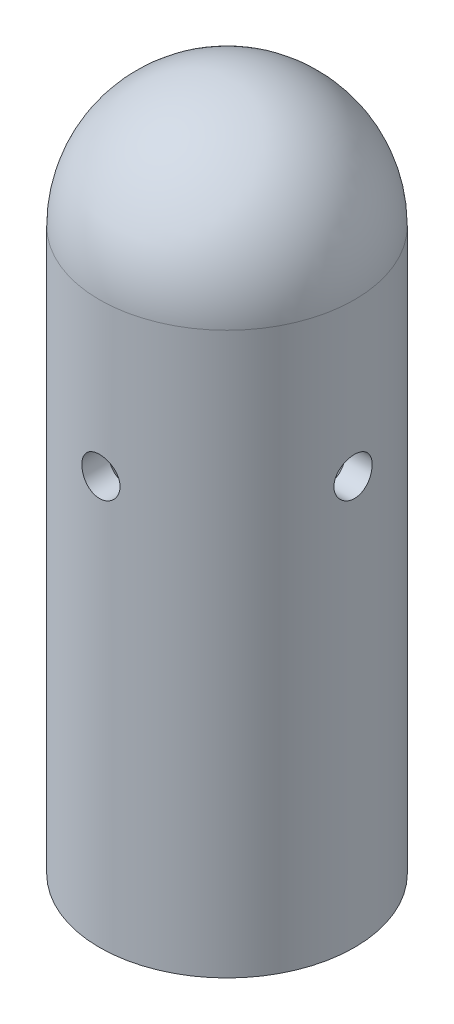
ISO-10303-21;
HEADER;
FILE_DESCRIPTION(('STEP AP214'),'2;1');
FILE_NAME('part.step','',(''),(''),'','','');
FILE_SCHEMA(('AUTOMOTIVE_DESIGN { 1 0 10303 214 1 1 1 1 }'));
ENDSEC;
DATA;
#1=APPLICATION_CONTEXT('core data for automotive mechanical design processes');
#2=APPLICATION_PROTOCOL_DEFINITION('international standard','automotive_design',2000,#1);
#3=PRODUCT_CONTEXT('',#1,'mechanical');
#4=PRODUCT('Part','Part','',(#3));
#5=PRODUCT_RELATED_PRODUCT_CATEGORY('part','',(#4));
#6=PRODUCT_DEFINITION_FORMATION('','',#4);
#7=PRODUCT_DEFINITION_CONTEXT('part definition',#1,'design');
#8=PRODUCT_DEFINITION('design','',#6,#7);
#9=PRODUCT_DEFINITION_SHAPE('','',#8);
#10=(LENGTH_UNIT() NAMED_UNIT(*) SI_UNIT(.MILLI.,.METRE.));
#11=(NAMED_UNIT(*) PLANE_ANGLE_UNIT() SI_UNIT($,.RADIAN.));
#12=(NAMED_UNIT(*) SI_UNIT($,.STERADIAN.) SOLID_ANGLE_UNIT());
#13=UNCERTAINTY_MEASURE_WITH_UNIT(LENGTH_MEASURE(1.E-05),#10,'distance_accuracy_value','');
#14=(GEOMETRIC_REPRESENTATION_CONTEXT(3) GLOBAL_UNCERTAINTY_ASSIGNED_CONTEXT((#13)) GLOBAL_UNIT_ASSIGNED_CONTEXT((#10,
#11,#12)) REPRESENTATION_CONTEXT('',''));
#15=CARTESIAN_POINT('',(0.,0.,0.));
#16=DIRECTION('',(0.,0.,1.));
#17=DIRECTION('',(1.,0.,0.));
#18=AXIS2_PLACEMENT_3D('',#15,#16,#17);
#19=CARTESIAN_POINT('',(0.,10.,0.));
#20=DIRECTION('',(0.,-1.,0.));
#21=DIRECTION('',(0.,0.,-1.));
#22=AXIS2_PLACEMENT_3D('',#19,#20,#21);
#23=PLANE('',#22);
#24=CARTESIAN_POINT('',(0.,10.,0.));
#25=DIRECTION('',(0.,-1.,0.));
#26=DIRECTION('',(0.,0.,-1.));
#27=AXIS2_PLACEMENT_3D('',#24,#25,#26);
#28=CIRCLE('',#27,40.);
#29=CARTESIAN_POINT('',(0.,10.,-40.));
#30=VERTEX_POINT('',#29);
#31=EDGE_CURVE('E52',#30,#30,#28,.T.);
#32=ORIENTED_EDGE('',*,*,#31,.F.);
#33=EDGE_LOOP('',(#32));
#34=FACE_BOUND('',#33,.T.);
#35=ADVANCED_FACE('F33',(#34),#23,.F.);
#36=CARTESIAN_POINT('',(0.,70.,0.));
#37=DIRECTION('',(0.,-1.,0.));
#38=DIRECTION('',(0.,0.,-1.));
#39=AXIS2_PLACEMENT_3D('',#36,#37,#38);
#40=CYLINDRICAL_SURFACE('',#39,40.);
#41=CARTESIAN_POINT('',(-39.2905841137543,160.,-7.50000000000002));
#42=CARTESIAN_POINT('',(-39.2905821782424,159.791286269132,-7.50000378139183));
#43=CARTESIAN_POINT('',(-39.2922503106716,159.582621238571,-7.49128526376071));
#44=CARTESIAN_POINT('',(-39.2988695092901,159.166733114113,-7.45648665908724));
#45=CARTESIAN_POINT('',(-39.3038211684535,158.959510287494,-7.43040343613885));
#46=CARTESIAN_POINT('',(-39.3168679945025,158.547947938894,-7.3610547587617));
#47=CARTESIAN_POINT('',(-39.3249649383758,158.343610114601,-7.3177795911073));
#48=CARTESIAN_POINT('',(-39.344067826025,157.939305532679,-7.21436697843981));
#49=CARTESIAN_POINT('',(-39.35507483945,157.739340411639,-7.15422333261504));
#50=CARTESIAN_POINT('',(-39.3796607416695,157.345521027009,-7.01762951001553));
#51=CARTESIAN_POINT('',(-39.3932362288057,157.151659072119,-6.94120088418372));
#52=CARTESIAN_POINT('',(-39.4225850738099,156.771031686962,-6.77252626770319));
#53=CARTESIAN_POINT('',(-39.4383592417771,156.584268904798,-6.68027444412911));
#54=CARTESIAN_POINT('',(-39.4716473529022,156.219263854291,-6.48068521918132));
#55=CARTESIAN_POINT('',(-39.4891604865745,156.041017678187,-6.37335482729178));
#56=CARTESIAN_POINT('',(-39.5254498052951,155.694078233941,-6.1442871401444));
#57=CARTESIAN_POINT('',(-39.5442264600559,155.525388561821,-6.02254447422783));
#58=CARTESIAN_POINT('',(-39.5827240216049,155.19698805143,-5.76413060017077));
#59=CARTESIAN_POINT('',(-39.6024529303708,155.037393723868,-5.62731249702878));
#60=CARTESIAN_POINT('',(-39.6421182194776,154.730203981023,-5.340729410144));
#61=CARTESIAN_POINT('',(-39.6620546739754,154.58261303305,-5.19095964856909));
#62=CARTESIAN_POINT('',(-39.7015655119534,154.300543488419,-4.87958110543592));
#63=CARTESIAN_POINT('',(-39.7211400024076,154.166060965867,-4.71797589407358));
#64=CARTESIAN_POINT('',(-39.759395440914,153.911040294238,-4.38391872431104));
#65=CARTESIAN_POINT('',(-39.7780760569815,153.790507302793,-4.21146279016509));
#66=CARTESIAN_POINT('',(-39.8141497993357,153.563449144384,-3.85560513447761));
#67=CARTESIAN_POINT('',(-39.8315322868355,153.457035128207,-3.67213138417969));
#68=CARTESIAN_POINT('',(-39.8643615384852,153.260062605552,-3.29669257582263));
#69=CARTESIAN_POINT('',(-39.8798082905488,153.169504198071,-3.10472746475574));
#70=CARTESIAN_POINT('',(-39.9083248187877,153.00493306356,-2.71367566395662));
#71=CARTESIAN_POINT('',(-39.9213947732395,152.930919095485,-2.51458950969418));
#72=CARTESIAN_POINT('',(-39.9447847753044,152.800001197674,-2.11070662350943));
#73=CARTESIAN_POINT('',(-39.9551047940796,152.743097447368,-1.90590983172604));
#74=CARTESIAN_POINT('',(-39.9725932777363,152.647422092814,-1.49454411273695));
#75=CARTESIAN_POINT('',(-39.979797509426,152.608444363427,-1.28802464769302));
#76=CARTESIAN_POINT('',(-39.9910287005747,152.54793597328,-0.872289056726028));
#77=CARTESIAN_POINT('',(-39.9950545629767,152.52641133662,-0.663072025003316));
#78=CARTESIAN_POINT('',(-39.9998073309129,152.501016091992,-0.243609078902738));
#79=CARTESIAN_POINT('',(-40.0005356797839,152.49713776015,-0.0333636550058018));
#80=CARTESIAN_POINT('',(-39.9986839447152,152.507024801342,0.386718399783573));
#81=CARTESIAN_POINT('',(-39.9961026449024,152.520796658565,0.59655485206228));
#82=CARTESIAN_POINT('',(-39.9835750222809,152.587938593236,1.2177418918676));
#83=CARTESIAN_POINT('',(-39.9689068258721,152.666796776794,1.6265518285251));
#84=CARTESIAN_POINT('',(-39.9284431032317,152.890678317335,2.42480280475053));
#85=CARTESIAN_POINT('',(-39.9026471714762,153.035704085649,2.81424313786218));
#86=CARTESIAN_POINT('',(-39.8425625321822,153.388638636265,3.56553223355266));
#87=CARTESIAN_POINT('',(-39.8082267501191,153.596897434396,3.92721300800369));
#88=CARTESIAN_POINT('',(-39.7348575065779,154.070128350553,4.61080473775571));
#89=CARTESIAN_POINT('',(-39.695823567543,154.335106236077,4.93271164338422));
#90=CARTESIAN_POINT('',(-39.616675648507,154.919078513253,5.53282676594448));
#91=CARTESIAN_POINT('',(-39.5765542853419,155.238838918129,5.81028918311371));
#92=CARTESIAN_POINT('',(-39.5003254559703,155.920747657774,6.30775894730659));
#93=CARTESIAN_POINT('',(-39.4642180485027,156.282896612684,6.5277654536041));
#94=CARTESIAN_POINT('',(-39.4000946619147,157.040291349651,6.90429252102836));
#95=CARTESIAN_POINT('',(-39.3720925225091,157.435592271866,7.0607046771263));
#96=CARTESIAN_POINT('',(-39.3275621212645,158.247505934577,7.30468285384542));
#97=CARTESIAN_POINT('',(-39.3110325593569,158.664116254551,7.39225667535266));
#98=CARTESIAN_POINT('',(-39.2915760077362,159.500096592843,7.49498370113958));
#99=CARTESIAN_POINT('',(-39.2884477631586,159.919330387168,7.51120849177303));
#100=CARTESIAN_POINT('',(-39.2956095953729,160.754517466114,7.47364816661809));
#101=CARTESIAN_POINT('',(-39.3058990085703,161.170470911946,7.41986651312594));
#102=CARTESIAN_POINT('',(-39.3385489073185,161.983763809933,7.2447444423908));
#103=CARTESIAN_POINT('',(-39.3608089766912,162.381228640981,7.12396576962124));
#104=CARTESIAN_POINT('',(-39.41480706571,163.150288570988,6.81885737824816));
#105=CARTESIAN_POINT('',(-39.4465457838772,163.521881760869,6.63452297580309));
#106=CARTESIAN_POINT('',(-39.5163775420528,164.233328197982,6.20513215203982));
#107=CARTESIAN_POINT('',(-39.5545397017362,164.572765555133,5.95939937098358));
#108=CARTESIAN_POINT('',(-39.6327456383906,165.20609733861,5.41486282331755));
#109=CARTESIAN_POINT('',(-39.6727895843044,165.499987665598,5.11605428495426));
#110=CARTESIAN_POINT('',(-39.731198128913,165.902209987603,4.63237490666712));
#111=CARTESIAN_POINT('',(-39.7505220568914,166.030616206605,4.4639167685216));
#112=CARTESIAN_POINT('',(-39.7879805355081,166.272773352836,4.11667793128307));
#113=CARTESIAN_POINT('',(-39.8061155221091,166.386529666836,3.93790106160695));
#114=CARTESIAN_POINT('',(-39.8406899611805,166.598601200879,3.57118519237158));
#115=CARTESIAN_POINT('',(-39.8571288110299,166.696910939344,3.3832429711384));
#116=CARTESIAN_POINT('',(-39.8878328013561,166.877288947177,2.99963235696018));
#117=CARTESIAN_POINT('',(-39.9020987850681,166.959363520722,2.80396699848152));
#118=CARTESIAN_POINT('',(-39.9279937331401,167.106327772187,2.4072065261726));
#119=CARTESIAN_POINT('',(-39.9396352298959,167.171299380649,2.20614257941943));
#120=CARTESIAN_POINT('',(-39.9600352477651,167.284057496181,1.79918606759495));
#121=CARTESIAN_POINT('',(-39.9687948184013,167.331850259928,1.59329528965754));
#122=CARTESIAN_POINT('',(-39.9831872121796,167.409907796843,1.17808873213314));
#123=CARTESIAN_POINT('',(-39.9888197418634,167.440170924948,0.968772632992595));
#124=CARTESIAN_POINT('',(-39.9967950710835,167.482917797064,0.548271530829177));
#125=CARTESIAN_POINT('',(-39.9991379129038,167.4954017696,0.337086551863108));
#126=CARTESIAN_POINT('',(-40.0004565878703,167.502435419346,-0.0823511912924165));
#127=CARTESIAN_POINT('',(-39.9994834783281,167.497257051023,-0.290599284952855));
#128=CARTESIAN_POINT('',(-39.9943099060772,167.469605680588,-0.705904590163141));
#129=CARTESIAN_POINT('',(-39.9901094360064,167.447132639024,-0.912961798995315));
#130=CARTESIAN_POINT('',(-39.9785981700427,167.385068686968,-1.32440357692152));
#131=CARTESIAN_POINT('',(-39.9712874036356,167.345477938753,-1.52878817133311));
#132=CARTESIAN_POINT('',(-39.9537586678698,167.249486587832,-1.93343805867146));
#133=CARTESIAN_POINT('',(-39.9435407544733,167.193086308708,-2.1337034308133));
#134=CARTESIAN_POINT('',(-39.9205003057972,167.064019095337,-2.52837181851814));
#135=CARTESIAN_POINT('',(-39.907682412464,166.991381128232,-2.72278458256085));
#136=CARTESIAN_POINT('',(-39.8797817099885,166.830320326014,-3.10478514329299));
#137=CARTESIAN_POINT('',(-39.8646989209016,166.741897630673,-3.29237300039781));
#138=CARTESIAN_POINT('',(-39.8326749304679,166.549881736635,-3.65950453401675));
#139=CARTESIAN_POINT('',(-39.8157333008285,166.446285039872,-3.83904634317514));
#140=CARTESIAN_POINT('',(-39.7804596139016,166.224702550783,-4.18878483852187));
#141=CARTESIAN_POINT('',(-39.7621280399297,166.106721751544,-4.35898473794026));
#142=CARTESIAN_POINT('',(-39.7242878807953,165.855314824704,-4.69141249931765));
#143=CARTESIAN_POINT('',(-39.7047659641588,165.721687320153,-4.85348658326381));
#144=CARTESIAN_POINT('',(-39.6653437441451,165.441390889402,-5.16577910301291));
#145=CARTESIAN_POINT('',(-39.6454435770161,165.294726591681,-5.31600171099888));
#146=CARTESIAN_POINT('',(-39.6057997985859,164.989220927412,-5.60372463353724));
#147=CARTESIAN_POINT('',(-39.5860562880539,164.830372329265,-5.74121728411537));
#148=CARTESIAN_POINT('',(-39.5472979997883,164.501710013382,-6.00238689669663));
#149=CARTESIAN_POINT('',(-39.5282829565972,164.331900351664,-6.12606892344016));
#150=CARTESIAN_POINT('',(-39.4913327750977,163.980720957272,-6.35993648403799));
#151=CARTESIAN_POINT('',(-39.4734098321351,163.799255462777,-6.46998022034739));
#152=CARTESIAN_POINT('',(-39.439373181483,163.427591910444,-6.67432185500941));
#153=CARTESIAN_POINT('',(-39.4232588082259,163.237397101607,-6.76862555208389));
#154=CARTESIAN_POINT('',(-39.3933151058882,162.849664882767,-6.94077547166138));
#155=CARTESIAN_POINT('',(-39.3794843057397,162.652132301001,-7.01863229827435));
#156=CARTESIAN_POINT('',(-39.3545083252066,162.25109067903,-7.15734754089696));
#157=CARTESIAN_POINT('',(-39.3433626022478,162.047582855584,-7.21820939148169));
#158=CARTESIAN_POINT('',(-39.3196644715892,161.541374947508,-7.34643414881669));
#159=CARTESIAN_POINT('',(-39.3088167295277,161.236042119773,-7.40394662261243));
#160=CARTESIAN_POINT('',(-39.2942780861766,160.620436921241,-7.48072621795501));
#161=CARTESIAN_POINT('',(-39.2905869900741,160.310164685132,-7.49999438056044));
#162=CARTESIAN_POINT('',(-39.2905841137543,160.,-7.50000000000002));
#163=B_SPLINE_CURVE_WITH_KNOTS('',3,(#41,#42,#43,#44,#45,#46,#47,#48,#49,#50,#51,#52,#53,#54,
#55,#56,#57,#58,#59,#60,#61,#62,#63,#64,#65,#66,#67,#68,#69,#70,#71,#72,#73,#74,#75,#76,#77,#78,
#79,#80,#81,#82,#83,#84,#85,#86,#87,#88,#89,#90,#91,#92,#93,#94,#95,#96,#97,#98,#99,#100,#101,
#102,#103,#104,#105,#106,#107,#108,#109,#110,#111,#112,#113,#114,#115,#116,#117,#118,#119,#120,
#121,#122,#123,#124,#125,#126,#127,#128,#129,#130,#131,#132,#133,#134,#135,#136,#137,#138,#139,
#140,#141,#142,#143,#144,#145,#146,#147,#148,#149,#150,#151,#152,#153,#154,#155,#156,#157,#158,
#159,#160,#161,#162),.UNSPECIFIED.,.T.,.F.,(4,2,2,2,2,2,2,2,2,2,2,2,2,2,2,2,2,2,2,2,2,2,2,2,2,2,
2,2,2,2,2,2,2,2,2,2,2,2,2,2,2,2,2,2,2,2,2,2,2,2,2,2,2,2,2,2,2,2,2,2,4),(0.,0.625868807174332,
1.25185067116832,1.87818671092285,2.50475329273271,3.13049579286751,3.75646945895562,
4.38215308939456,5.00807061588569,5.64074127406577,6.27364632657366,6.90636124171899,
7.53930935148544,8.17697703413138,8.81464869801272,9.45227251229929,10.0899030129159,
10.7200060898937,11.3503265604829,11.9803711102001,12.6106471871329,13.8540467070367,
15.0974915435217,16.3479487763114,17.5985332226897,18.8682949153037,20.1380751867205,
21.4100109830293,22.681802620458,23.9344266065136,25.1869886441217,26.4292037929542,
27.6715105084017,28.928157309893,30.1849171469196,30.8223805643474,31.4596089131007,
32.0970628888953,32.7342688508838,33.3683643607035,34.0022286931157,34.6361525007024,
35.2700681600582,35.8942674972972,36.5184682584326,37.1426631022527,37.7668459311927,
38.3899240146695,39.0129965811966,39.6362130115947,40.2592137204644,40.8913634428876,
41.5232896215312,42.1555938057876,42.7876653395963,43.4258379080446,44.0637748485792,
44.7012992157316,45.3386946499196,46.2688092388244,47.1988985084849),.UNSPECIFIED.);
#164=CARTESIAN_POINT('',(-39.2905841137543,160.,-7.50000000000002));
#165=VERTEX_POINT('',#164);
#166=EDGE_CURVE('E81',#165,#165,#163,.T.);
#167=ORIENTED_EDGE('',*,*,#166,.T.);
#168=EDGE_LOOP('',(#167));
#169=FACE_BOUND('',#168,.T.);
#170=CARTESIAN_POINT('',(39.2905841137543,160.,-7.50000000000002));
#171=CARTESIAN_POINT('',(39.2905821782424,160.208713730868,-7.50000378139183));
#172=CARTESIAN_POINT('',(39.2922503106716,160.417378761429,-7.49128526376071));
#173=CARTESIAN_POINT('',(39.2988695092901,160.833266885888,-7.45648665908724));
#174=CARTESIAN_POINT('',(39.3038211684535,161.040489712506,-7.43040343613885));
#175=CARTESIAN_POINT('',(39.3168679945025,161.452052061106,-7.3610547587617));
#176=CARTESIAN_POINT('',(39.3249649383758,161.656389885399,-7.3177795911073));
#177=CARTESIAN_POINT('',(39.344067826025,162.060694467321,-7.21436697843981));
#178=CARTESIAN_POINT('',(39.35507483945,162.260659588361,-7.15422333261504));
#179=CARTESIAN_POINT('',(39.3796607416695,162.654478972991,-7.01762951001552));
#180=CARTESIAN_POINT('',(39.3932362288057,162.848340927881,-6.94120088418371));
#181=CARTESIAN_POINT('',(39.4225850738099,163.228968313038,-6.77252626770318));
#182=CARTESIAN_POINT('',(39.4383592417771,163.415731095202,-6.6802744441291));
#183=CARTESIAN_POINT('',(39.4716473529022,163.78073614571,-6.48068521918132));
#184=CARTESIAN_POINT('',(39.4891604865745,163.958982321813,-6.37335482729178));
#185=CARTESIAN_POINT('',(39.5254498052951,164.305921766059,-6.14428714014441));
#186=CARTESIAN_POINT('',(39.5442264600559,164.47461143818,-6.02254447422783));
#187=CARTESIAN_POINT('',(39.5827240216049,164.80301194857,-5.76413060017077));
#188=CARTESIAN_POINT('',(39.6024529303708,164.962606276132,-5.62731249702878));
#189=CARTESIAN_POINT('',(39.6421182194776,165.269796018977,-5.340729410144));
#190=CARTESIAN_POINT('',(39.6620546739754,165.41738696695,-5.1909596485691));
#191=CARTESIAN_POINT('',(39.7015655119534,165.699456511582,-4.87958110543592));
#192=CARTESIAN_POINT('',(39.7211400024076,165.833939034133,-4.71797589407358));
#193=CARTESIAN_POINT('',(39.759395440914,166.088959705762,-4.38391872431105));
#194=CARTESIAN_POINT('',(39.7780760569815,166.209492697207,-4.2114627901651));
#195=CARTESIAN_POINT('',(39.8141497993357,166.436550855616,-3.85560513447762));
#196=CARTESIAN_POINT('',(39.8315322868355,166.542964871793,-3.67213138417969));
#197=CARTESIAN_POINT('',(39.8643615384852,166.739937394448,-3.29669257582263));
#198=CARTESIAN_POINT('',(39.8798082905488,166.830495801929,-3.10472746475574));
#199=CARTESIAN_POINT('',(39.9083248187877,166.99506693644,-2.71367566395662));
#200=CARTESIAN_POINT('',(39.9213947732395,167.069080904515,-2.51458950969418));
#201=CARTESIAN_POINT('',(39.9447847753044,167.199998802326,-2.11070662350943));
#202=CARTESIAN_POINT('',(39.9551047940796,167.256902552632,-1.90590983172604));
#203=CARTESIAN_POINT('',(39.9725932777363,167.352577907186,-1.49454411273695));
#204=CARTESIAN_POINT('',(39.979797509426,167.391555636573,-1.28802464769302));
#205=CARTESIAN_POINT('',(39.9910287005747,167.452064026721,-0.872289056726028));
#206=CARTESIAN_POINT('',(39.9950545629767,167.47358866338,-0.663072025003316));
#207=CARTESIAN_POINT('',(39.9998073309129,167.498983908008,-0.243609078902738));
#208=CARTESIAN_POINT('',(40.0005356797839,167.50286223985,-0.0333636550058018));
#209=CARTESIAN_POINT('',(39.9986839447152,167.492975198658,0.386718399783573));
#210=CARTESIAN_POINT('',(39.9961026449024,167.479203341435,0.59655485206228));
#211=CARTESIAN_POINT('',(39.9835750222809,167.412061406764,1.2177418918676));
#212=CARTESIAN_POINT('',(39.9689068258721,167.333203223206,1.6265518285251));
#213=CARTESIAN_POINT('',(39.9284431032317,167.109321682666,2.42480280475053));
#214=CARTESIAN_POINT('',(39.9026471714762,166.964295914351,2.81424313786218));
#215=CARTESIAN_POINT('',(39.8425625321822,166.611361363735,3.56553223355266));
#216=CARTESIAN_POINT('',(39.8082267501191,166.403102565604,3.92721300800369));
#217=CARTESIAN_POINT('',(39.7348575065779,165.929871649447,4.61080473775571));
#218=CARTESIAN_POINT('',(39.695823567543,165.664893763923,4.93271164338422));
#219=CARTESIAN_POINT('',(39.616675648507,165.080921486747,5.53282676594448));
#220=CARTESIAN_POINT('',(39.5765542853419,164.761161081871,5.81028918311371));
#221=CARTESIAN_POINT('',(39.5003254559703,164.079252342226,6.30775894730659));
#222=CARTESIAN_POINT('',(39.4642180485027,163.717103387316,6.5277654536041));
#223=CARTESIAN_POINT('',(39.4000946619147,162.959708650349,6.90429252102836));
#224=CARTESIAN_POINT('',(39.3720925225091,162.564407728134,7.0607046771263));
#225=CARTESIAN_POINT('',(39.3275621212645,161.752494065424,7.30468285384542));
#226=CARTESIAN_POINT('',(39.3110325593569,161.335883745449,7.39225667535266));
#227=CARTESIAN_POINT('',(39.2915760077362,160.499903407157,7.49498370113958));
#228=CARTESIAN_POINT('',(39.2884477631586,160.080669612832,7.51120849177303));
#229=CARTESIAN_POINT('',(39.2956095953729,159.245482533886,7.47364816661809));
#230=CARTESIAN_POINT('',(39.3058990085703,158.829529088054,7.41986651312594));
#231=CARTESIAN_POINT('',(39.3385489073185,158.016236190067,7.2447444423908));
#232=CARTESIAN_POINT('',(39.3608089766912,157.618771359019,7.12396576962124));
#233=CARTESIAN_POINT('',(39.41480706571,156.849711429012,6.81885737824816));
#234=CARTESIAN_POINT('',(39.4465457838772,156.478118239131,6.63452297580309));
#235=CARTESIAN_POINT('',(39.5163775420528,155.766671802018,6.20513215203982));
#236=CARTESIAN_POINT('',(39.5545397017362,155.427234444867,5.95939937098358));
#237=CARTESIAN_POINT('',(39.6327456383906,154.79390266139,5.41486282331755));
#238=CARTESIAN_POINT('',(39.6727895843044,154.500012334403,5.11605428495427));
#239=CARTESIAN_POINT('',(39.731198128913,154.097790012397,4.63237490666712));
#240=CARTESIAN_POINT('',(39.7505220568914,153.969383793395,4.46391676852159));
#241=CARTESIAN_POINT('',(39.7879805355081,153.727226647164,4.11667793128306));
#242=CARTESIAN_POINT('',(39.8061155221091,153.613470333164,3.93790106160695));
#243=CARTESIAN_POINT('',(39.8406899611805,153.401398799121,3.57118519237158));
#244=CARTESIAN_POINT('',(39.8571288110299,153.303089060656,3.3832429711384));
#245=CARTESIAN_POINT('',(39.8878328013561,153.122711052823,2.99963235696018));
#246=CARTESIAN_POINT('',(39.9020987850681,153.040636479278,2.80396699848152));
#247=CARTESIAN_POINT('',(39.9279937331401,152.893672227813,2.4072065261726));
#248=CARTESIAN_POINT('',(39.9396352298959,152.828700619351,2.20614257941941));
#249=CARTESIAN_POINT('',(39.9600352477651,152.715942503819,1.79918606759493));
#250=CARTESIAN_POINT('',(39.9687948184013,152.668149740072,1.59329528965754));
#251=CARTESIAN_POINT('',(39.9831872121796,152.590092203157,1.17808873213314));
#252=CARTESIAN_POINT('',(39.9888197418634,152.559829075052,0.968772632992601));
#253=CARTESIAN_POINT('',(39.9967950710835,152.517082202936,0.54827153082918));
#254=CARTESIAN_POINT('',(39.9991379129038,152.5045982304,0.33708655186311));
#255=CARTESIAN_POINT('',(40.0004565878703,152.497564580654,-0.0823511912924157));
#256=CARTESIAN_POINT('',(39.9994834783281,152.502742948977,-0.290599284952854));
#257=CARTESIAN_POINT('',(39.9943099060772,152.530394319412,-0.70590459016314));
#258=CARTESIAN_POINT('',(39.9901094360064,152.552867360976,-0.912961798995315));
#259=CARTESIAN_POINT('',(39.9785981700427,152.614931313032,-1.32440357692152));
#260=CARTESIAN_POINT('',(39.9712874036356,152.654522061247,-1.5287881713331));
#261=CARTESIAN_POINT('',(39.9537586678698,152.750513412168,-1.93343805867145));
#262=CARTESIAN_POINT('',(39.9435407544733,152.806913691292,-2.1337034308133));
#263=CARTESIAN_POINT('',(39.9205003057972,152.935980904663,-2.52837181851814));
#264=CARTESIAN_POINT('',(39.907682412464,153.008618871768,-2.72278458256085));
#265=CARTESIAN_POINT('',(39.8797817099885,153.169679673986,-3.10478514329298));
#266=CARTESIAN_POINT('',(39.8646989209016,153.258102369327,-3.2923730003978));
#267=CARTESIAN_POINT('',(39.8326749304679,153.450118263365,-3.65950453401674));
#268=CARTESIAN_POINT('',(39.8157333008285,153.553714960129,-3.83904634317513));
#269=CARTESIAN_POINT('',(39.7804596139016,153.775297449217,-4.18878483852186));
#270=CARTESIAN_POINT('',(39.7621280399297,153.893278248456,-4.35898473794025));
#271=CARTESIAN_POINT('',(39.7242878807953,154.144685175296,-4.69141249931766));
#272=CARTESIAN_POINT('',(39.7047659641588,154.278312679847,-4.85348658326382));
#273=CARTESIAN_POINT('',(39.6653437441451,154.558609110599,-5.16577910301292));
#274=CARTESIAN_POINT('',(39.6454435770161,154.70527340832,-5.31600171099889));
#275=CARTESIAN_POINT('',(39.6057997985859,155.010779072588,-5.60372463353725));
#276=CARTESIAN_POINT('',(39.5860562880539,155.169627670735,-5.74121728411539));
#277=CARTESIAN_POINT('',(39.5472979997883,155.498289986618,-6.00238689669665));
#278=CARTESIAN_POINT('',(39.5282829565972,155.668099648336,-6.12606892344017));
#279=CARTESIAN_POINT('',(39.4913327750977,156.019279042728,-6.35993648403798));
#280=CARTESIAN_POINT('',(39.4734098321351,156.200744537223,-6.46998022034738));
#281=CARTESIAN_POINT('',(39.439373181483,156.572408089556,-6.6743218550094));
#282=CARTESIAN_POINT('',(39.4232588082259,156.762602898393,-6.76862555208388));
#283=CARTESIAN_POINT('',(39.3933151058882,157.150335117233,-6.94077547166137));
#284=CARTESIAN_POINT('',(39.3794843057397,157.347867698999,-7.01863229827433));
#285=CARTESIAN_POINT('',(39.3545083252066,157.74890932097,-7.15734754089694));
#286=CARTESIAN_POINT('',(39.3433626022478,157.952417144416,-7.21820939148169));
#287=CARTESIAN_POINT('',(39.3196644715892,158.458625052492,-7.34643414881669));
#288=CARTESIAN_POINT('',(39.3088167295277,158.763957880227,-7.40394662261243));
#289=CARTESIAN_POINT('',(39.2942780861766,159.379563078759,-7.48072621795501));
#290=CARTESIAN_POINT('',(39.2905869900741,159.689835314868,-7.49999438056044));
#291=CARTESIAN_POINT('',(39.2905841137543,160.,-7.50000000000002));
#292=B_SPLINE_CURVE_WITH_KNOTS('',3,(#170,#171,#172,#173,#174,#175,#176,#177,#178,#179,#180,
#181,#182,#183,#184,#185,#186,#187,#188,#189,#190,#191,#192,#193,#194,#195,#196,#197,#198,#199,
#200,#201,#202,#203,#204,#205,#206,#207,#208,#209,#210,#211,#212,#213,#214,#215,#216,#217,#218,
#219,#220,#221,#222,#223,#224,#225,#226,#227,#228,#229,#230,#231,#232,#233,#234,#235,#236,#237,
#238,#239,#240,#241,#242,#243,#244,#245,#246,#247,#248,#249,#250,#251,#252,#253,#254,#255,#256,
#257,#258,#259,#260,#261,#262,#263,#264,#265,#266,#267,#268,#269,#270,#271,#272,#273,#274,#275,
#276,#277,#278,#279,#280,#281,#282,#283,#284,#285,#286,#287,#288,#289,#290,#291),.UNSPECIFIED.,
.T.,.F.,(4,2,2,2,2,2,2,2,2,2,2,2,2,2,2,2,2,2,2,2,2,2,2,2,2,2,2,2,2,2,2,2,2,2,2,2,2,2,2,2,2,2,2,
2,2,2,2,2,2,2,2,2,2,2,2,2,2,2,2,2,4),(0.,0.625868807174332,1.25185067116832,1.87818671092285,
2.50475329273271,3.13049579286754,3.75646945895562,4.38215308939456,5.00807061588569,
5.64074127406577,6.27364632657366,6.90636124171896,7.53930935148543,8.17697703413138,
8.81464869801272,9.45227251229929,10.0899030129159,10.7200060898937,11.3503265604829,
11.9803711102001,12.6106471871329,13.8540467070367,15.0974915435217,16.3479487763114,
17.5985332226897,18.8682949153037,20.1380751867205,21.4100109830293,22.681802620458,
23.9344266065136,25.1869886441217,26.4292037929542,27.6715105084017,28.928157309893,
30.1849171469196,30.8223805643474,31.4596089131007,32.0970628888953,32.7342688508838,
33.3683643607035,34.0022286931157,34.6361525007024,35.2700681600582,35.8942674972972,
36.5184682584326,37.1426631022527,37.7668459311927,38.3899240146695,39.0129965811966,
39.6362130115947,40.2592137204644,40.8913634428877,41.5232896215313,42.1555938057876,
42.7876653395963,43.4258379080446,44.0637748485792,44.7012992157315,45.3386946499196,
46.2688092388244,47.1988985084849),.UNSPECIFIED.);
#293=CARTESIAN_POINT('',(39.2905841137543,160.,-7.50000000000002));
#294=VERTEX_POINT('',#293);
#295=EDGE_CURVE('E77',#294,#294,#292,.T.);
#296=ORIENTED_EDGE('',*,*,#295,.T.);
#297=EDGE_LOOP('',(#296));
#298=FACE_BOUND('',#297,.T.);
#299=CARTESIAN_POINT('',(0.,167.5,-40.));
#300=CARTESIAN_POINT('',(0.208750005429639,167.500003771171,-40.0000018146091));
#301=CARTESIAN_POINT('',(0.417451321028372,167.491282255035,-39.9983629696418));
#302=CARTESIAN_POINT('',(0.833413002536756,167.456471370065,-39.9918572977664));
#303=CARTESIAN_POINT('',(1.04067310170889,167.430378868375,-39.9869898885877));
#304=CARTESIAN_POINT('',(1.45231077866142,167.361004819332,-39.9741571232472));
#305=CARTESIAN_POINT('',(1.65668666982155,167.317713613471,-39.9661900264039));
#306=CARTESIAN_POINT('',(2.06106821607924,167.214261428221,-39.9473776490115));
#307=CARTESIAN_POINT('',(2.26107223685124,167.154094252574,-39.9365313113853));
#308=CARTESIAN_POINT('',(2.65497439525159,167.017443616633,-39.9122788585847));
#309=CARTESIAN_POINT('',(2.84888005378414,166.940981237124,-39.8988760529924));
#310=CARTESIAN_POINT('',(3.22959116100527,166.772230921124,-39.8698658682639));
#311=CARTESIAN_POINT('',(3.41639396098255,166.679937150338,-39.8542576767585));
#312=CARTESIAN_POINT('',(3.78147202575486,166.480257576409,-39.8212763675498));
#313=CARTESIAN_POINT('',(3.9597512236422,166.37287882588,-39.8039040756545));
#314=CARTESIAN_POINT('',(4.30674780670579,166.143709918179,-39.7678559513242));
#315=CARTESIAN_POINT('',(4.47546159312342,166.021914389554,-39.7491796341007));
#316=CARTESIAN_POINT('',(4.80383014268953,165.763447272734,-39.7108401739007));
#317=CARTESIAN_POINT('',(4.96337292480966,165.626634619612,-39.6911688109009));
#318=CARTESIAN_POINT('',(5.27045902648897,165.340073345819,-39.6515604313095));
#319=CARTESIAN_POINT('',(5.41799787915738,165.190319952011,-39.6316233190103));
#320=CARTESIAN_POINT('',(5.69996538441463,164.878984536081,-39.5920530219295));
#321=CARTESIAN_POINT('',(5.83439788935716,164.717406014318,-39.5724197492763));
#322=CARTESIAN_POINT('',(6.08932223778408,164.383412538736,-39.5339952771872));
#323=CARTESIAN_POINT('',(6.20980892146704,164.210993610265,-39.5152043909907));
#324=CARTESIAN_POINT('',(6.43681359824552,163.855166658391,-39.4788646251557));
#325=CARTESIAN_POINT('',(6.5432161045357,163.671683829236,-39.461326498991));
#326=CARTESIAN_POINT('',(6.74016524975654,163.296226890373,-39.4281644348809));
#327=CARTESIAN_POINT('',(6.83071170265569,163.104252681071,-39.4125405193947));
#328=CARTESIAN_POINT('',(6.99525813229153,162.713183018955,-39.3836685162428));
#329=CARTESIAN_POINT('',(7.06925945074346,162.514088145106,-39.370420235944));
#330=CARTESIAN_POINT('',(7.2001517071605,162.110185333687,-39.3466929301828));
#331=CARTESIAN_POINT('',(7.25704246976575,161.90537733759,-39.3362139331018));
#332=CARTESIAN_POINT('',(7.35270249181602,161.493939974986,-39.3184448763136));
#333=CARTESIAN_POINT('',(7.39167387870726,161.287359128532,-39.3111193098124));
#334=CARTESIAN_POINT('',(7.45214726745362,160.87156972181,-39.2997003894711));
#335=CARTESIAN_POINT('',(7.47364958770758,160.662361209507,-39.2956069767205));
#336=CARTESIAN_POINT('',(7.49901166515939,160.2428542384,-39.2907748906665));
#337=CARTESIAN_POINT('',(7.5028727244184,160.032555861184,-39.2900359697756));
#338=CARTESIAN_POINT('',(7.49292465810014,159.612393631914,-39.2919343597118));
#339=CARTESIAN_POINT('',(7.47911563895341,159.402529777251,-39.2945716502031));
#340=CARTESIAN_POINT('',(7.43424108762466,158.987563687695,-39.3030860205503));
#341=CARTESIAN_POINT('',(7.4034086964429,158.782435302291,-39.3089193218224));
#342=CARTESIAN_POINT('',(7.32488121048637,158.375474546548,-39.323627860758));
#343=CARTESIAN_POINT('',(7.2771803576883,158.173643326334,-39.3325041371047));
#344=CARTESIAN_POINT('',(7.16529025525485,157.7748084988,-39.3530411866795));
#345=CARTESIAN_POINT('',(7.10110642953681,157.577803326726,-39.3647010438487));
#346=CARTESIAN_POINT('',(6.95673659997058,157.18988844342,-39.3904705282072));
#347=CARTESIAN_POINT('',(6.8765446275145,156.998981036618,-39.4045810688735));
#348=CARTESIAN_POINT('',(6.61176464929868,156.435286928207,-39.4501830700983));
#349=CARTESIAN_POINT('',(6.40353274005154,156.073519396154,-39.4848365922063));
#350=CARTESIAN_POINT('',(5.93044638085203,155.389914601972,-39.5586511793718));
#351=CARTESIAN_POINT('',(5.66558618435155,155.068081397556,-39.5978127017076));
#352=CARTESIAN_POINT('',(5.08170133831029,154.467892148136,-39.6769993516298));
#353=CARTESIAN_POINT('',(4.76188882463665,154.19030126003,-39.7170283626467));
#354=CARTESIAN_POINT('',(4.07983854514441,153.692609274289,-39.7928694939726));
#355=CARTESIAN_POINT('',(3.71760035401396,153.472508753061,-39.8286815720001));
#356=CARTESIAN_POINT('',(2.96017545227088,153.095912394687,-39.8921269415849));
#357=CARTESIAN_POINT('',(2.56494821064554,152.939496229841,-39.9197499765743));
#358=CARTESIAN_POINT('',(1.75319518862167,152.695489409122,-39.9636252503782));
#359=CARTESIAN_POINT('',(1.33667167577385,152.607891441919,-39.9798786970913));
#360=CARTESIAN_POINT('',(0.500744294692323,152.50506919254,-39.9990181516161));
#361=CARTESIAN_POINT('',(0.0814737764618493,152.488795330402,-40.0020980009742));
#362=CARTESIAN_POINT('',(-0.75380995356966,152.526280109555,-39.9950767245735));
#363=CARTESIAN_POINT('',(-1.16982332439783,152.580035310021,-39.98497624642));
#364=CARTESIAN_POINT('',(-1.98339415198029,152.755135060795,-39.9528572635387));
#365=CARTESIAN_POINT('',(-2.38107031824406,152.875948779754,-39.9309323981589));
#366=CARTESIAN_POINT('',(-3.15069414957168,153.181326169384,-39.8775858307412));
#367=CARTESIAN_POINT('',(-3.52264006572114,153.365894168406,-39.8461634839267));
#368=CARTESIAN_POINT('',(-4.05529880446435,153.687439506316,-39.7943106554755));
#369=CARTESIAN_POINT('',(-4.22959131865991,153.802884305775,-39.7761185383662));
#370=CARTESIAN_POINT('',(-4.56785316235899,154.047837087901,-39.7386912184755));
#371=CARTESIAN_POINT('',(-4.73182609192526,154.177340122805,-39.7194563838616));
#372=CARTESIAN_POINT('',(-5.04842258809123,154.449589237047,-39.6804600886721));
#373=CARTESIAN_POINT('',(-5.20104108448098,154.592341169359,-39.6606983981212));
#374=CARTESIAN_POINT('',(-5.49379091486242,154.890027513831,-39.621207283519));
#375=CARTESIAN_POINT('',(-5.63392671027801,155.044957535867,-39.6014778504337));
#376=CARTESIAN_POINT('',(-5.9026479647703,155.368204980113,-39.5623235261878));
#377=CARTESIAN_POINT('',(-6.03104923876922,155.536676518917,-39.542906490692));
#378=CARTESIAN_POINT('',(-6.27315502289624,155.883897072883,-39.5052216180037));
#379=CARTESIAN_POINT('',(-6.38686493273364,156.062642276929,-39.4869533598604));
#380=CARTESIAN_POINT('',(-6.598860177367,156.429299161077,-39.4520797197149));
#381=CARTESIAN_POINT('',(-6.69714001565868,156.617214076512,-39.4354749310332));
#382=CARTESIAN_POINT('',(-6.87746127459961,157.000764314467,-39.4044274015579));
#383=CARTESIAN_POINT('',(-6.95950899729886,157.196396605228,-39.3899838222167));
#384=CARTESIAN_POINT('',(-7.10645568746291,157.593167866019,-39.3637375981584));
#385=CARTESIAN_POINT('',(-7.17143011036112,157.794278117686,-39.3519233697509));
#386=CARTESIAN_POINT('',(-7.2841863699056,158.20133027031,-39.33120793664));
#387=CARTESIAN_POINT('',(-7.33197457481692,158.407270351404,-39.3223056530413));
#388=CARTESIAN_POINT('',(-7.41001514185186,158.822578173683,-39.3076742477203));
#389=CARTESIAN_POINT('',(-7.44026592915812,159.031946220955,-39.3019454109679));
#390=CARTESIAN_POINT('',(-7.48297956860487,159.45255260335,-39.2938352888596));
#391=CARTESIAN_POINT('',(-7.49544263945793,159.663790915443,-39.2914539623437));
#392=CARTESIAN_POINT('',(-7.50242336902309,160.083174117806,-39.2901215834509));
#393=CARTESIAN_POINT('',(-7.49722631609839,160.291314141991,-39.2911159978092));
#394=CARTESIAN_POINT('',(-7.46955090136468,160.706473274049,-39.2963866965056));
#395=CARTESIAN_POINT('',(-7.4470665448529,160.913491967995,-39.3006641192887));
#396=CARTESIAN_POINT('',(-7.38499291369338,161.324813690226,-39.3123755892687));
#397=CARTESIAN_POINT('',(-7.34540711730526,161.529117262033,-39.3198089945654));
#398=CARTESIAN_POINT('',(-7.24943752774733,161.933614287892,-39.3376160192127));
#399=CARTESIAN_POINT('',(-7.19305323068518,162.133807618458,-39.3479897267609));
#400=CARTESIAN_POINT('',(-7.06403915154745,162.528307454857,-39.3713555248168));
#401=CARTESIAN_POINT('',(-6.9914404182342,162.722624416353,-39.384342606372));
#402=CARTESIAN_POINT('',(-6.83047400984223,163.104440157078,-39.4125779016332));
#403=CARTESIAN_POINT('',(-6.74210638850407,163.291938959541,-39.4278261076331));
#404=CARTESIAN_POINT('',(-6.55023148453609,163.658870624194,-39.4601562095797));
#405=CARTESIAN_POINT('',(-6.44672327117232,163.838302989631,-39.4772382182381));
#406=CARTESIAN_POINT('',(-6.22529681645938,164.187898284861,-39.5127605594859));
#407=CARTESIAN_POINT('',(-6.10737866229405,164.358061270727,-39.531200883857));
#408=CARTESIAN_POINT('',(-5.85604152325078,164.690506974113,-39.5692199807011));
#409=CARTESIAN_POINT('',(-5.72241450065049,164.852630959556,-39.5888117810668));
#410=CARTESIAN_POINT('',(-5.44210850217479,165.165024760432,-39.6283165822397));
#411=CARTESIAN_POINT('',(-5.29543414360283,165.315298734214,-39.6482294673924));
#412=CARTESIAN_POINT('',(-4.98989811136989,165.60312333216,-39.6878401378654));
#413=CARTESIAN_POINT('',(-4.83102926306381,165.740666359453,-39.7075377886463));
#414=CARTESIAN_POINT('',(-4.50231607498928,166.001934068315,-39.7461510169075));
#415=CARTESIAN_POINT('',(-4.33247580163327,166.125663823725,-39.7650668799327));
#416=CARTESIAN_POINT('',(-3.98126969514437,166.359593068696,-39.801770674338));
#417=CARTESIAN_POINT('',(-3.79981050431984,166.469654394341,-39.8195463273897));
#418=CARTESIAN_POINT('',(-3.42815726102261,166.674031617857,-39.8532625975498));
#419=CARTESIAN_POINT('',(-3.23796645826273,166.768353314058,-39.8692038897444));
#420=CARTESIAN_POINT('',(-2.85024127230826,166.940538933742,-39.8987955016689));
#421=CARTESIAN_POINT('',(-2.65271168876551,167.018413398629,-39.9124472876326));
#422=CARTESIAN_POINT('',(-2.25167735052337,167.157163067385,-39.9370797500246));
#423=CARTESIAN_POINT('',(-2.04817380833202,167.21804169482,-39.9480609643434));
#424=CARTESIAN_POINT('',(-1.54187254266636,167.346334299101,-39.9714011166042));
#425=CARTESIAN_POINT('',(-1.23643982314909,167.403884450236,-39.9820722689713));
#426=CARTESIAN_POINT('',(-0.620635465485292,167.480714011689,-39.9963702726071));
#427=CARTESIAN_POINT('',(-0.310263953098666,167.49999439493,-39.9999973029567));
#428=CARTESIAN_POINT('',(0.,167.5,-40.));
#429=B_SPLINE_CURVE_WITH_KNOTS('',3,(#299,#300,#301,#302,#303,#304,#305,#306,#307,#308,#309,
#310,#311,#312,#313,#314,#315,#316,#317,#318,#319,#320,#321,#322,#323,#324,#325,#326,#327,#328,
#329,#330,#331,#332,#333,#334,#335,#336,#337,#338,#339,#340,#341,#342,#343,#344,#345,#346,#347,
#348,#349,#350,#351,#352,#353,#354,#355,#356,#357,#358,#359,#360,#361,#362,#363,#364,#365,#366,
#367,#368,#369,#370,#371,#372,#373,#374,#375,#376,#377,#378,#379,#380,#381,#382,#383,#384,#385,
#386,#387,#388,#389,#390,#391,#392,#393,#394,#395,#396,#397,#398,#399,#400,#401,#402,#403,#404,
#405,#406,#407,#408,#409,#410,#411,#412,#413,#414,#415,#416,#417,#418,#419,#420,#421,#422,#423,
#424,#425,#426,#427,#428),.UNSPECIFIED.,.T.,.F.,(4,2,2,2,2,2,2,2,2,2,2,2,2,2,2,2,2,2,2,2,2,2,2,
2,2,2,2,2,2,2,2,2,2,2,2,2,2,2,2,2,2,2,2,2,2,2,2,2,2,2,2,2,2,2,2,2,2,2,2,2,2,2,2,2,4),(0.,
0.625977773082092,1.25206847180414,1.87851127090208,2.50518437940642,3.13105164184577,
3.75715005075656,4.38295671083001,5.00899727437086,5.64152469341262,6.2742864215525,
6.90686159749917,7.53967007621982,8.17738252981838,8.81510246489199,9.45277066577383,
10.0904454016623,10.7207393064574,11.3510217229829,11.981257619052,12.6114897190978,
13.2332972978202,13.855317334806,14.4771329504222,15.0991808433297,16.3494134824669,
17.5997730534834,18.8698387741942,20.1399172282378,21.4115797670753,22.6831071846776,
23.9358590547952,25.1885493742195,26.4314620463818,27.674459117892,28.3034055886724,
28.9321314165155,29.5611363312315,30.1899155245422,30.8272944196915,31.4644383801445,
32.1018087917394,32.7389312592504,33.3731887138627,34.007210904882,34.6412900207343,
35.2753613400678,35.8992386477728,36.5233323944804,37.1472992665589,37.7712848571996,
38.3940856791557,39.0168843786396,39.6397213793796,40.2625546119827,40.8948376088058,
41.5268977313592,42.1593326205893,42.7915344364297,43.4296808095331,44.0675915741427,
44.705092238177,45.3424643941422,46.272875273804,47.2032624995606),.UNSPECIFIED.);
#430=CARTESIAN_POINT('',(0.,167.5,-40.));
#431=VERTEX_POINT('',#430);
#432=EDGE_CURVE('E57',#431,#431,#429,.T.);
#433=ORIENTED_EDGE('',*,*,#432,.T.);
#434=EDGE_LOOP('',(#433));
#435=FACE_BOUND('',#434,.T.);
#436=CARTESIAN_POINT('',(7.50000000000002,160.,39.2905841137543));
#437=CARTESIAN_POINT('',(7.50000378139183,160.208713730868,39.2905821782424));
#438=CARTESIAN_POINT('',(7.49128526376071,160.417378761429,39.2922503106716));
#439=CARTESIAN_POINT('',(7.45648665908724,160.833266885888,39.2988695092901));
#440=CARTESIAN_POINT('',(7.43040343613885,161.040489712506,39.3038211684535));
#441=CARTESIAN_POINT('',(7.3610547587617,161.452052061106,39.3168679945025));
#442=CARTESIAN_POINT('',(7.3177795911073,161.656389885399,39.3249649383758));
#443=CARTESIAN_POINT('',(7.21436697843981,162.060694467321,39.344067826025));
#444=CARTESIAN_POINT('',(7.15422333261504,162.260659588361,39.35507483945));
#445=CARTESIAN_POINT('',(7.01762951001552,162.654478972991,39.3796607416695));
#446=CARTESIAN_POINT('',(6.94120088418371,162.848340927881,39.3932362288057));
#447=CARTESIAN_POINT('',(6.77252626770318,163.228968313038,39.4225850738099));
#448=CARTESIAN_POINT('',(6.6802744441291,163.415731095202,39.4383592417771));
#449=CARTESIAN_POINT('',(6.48068521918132,163.78073614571,39.4716473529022));
#450=CARTESIAN_POINT('',(6.37335482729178,163.958982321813,39.4891604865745));
#451=CARTESIAN_POINT('',(6.14428714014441,164.305921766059,39.5254498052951));
#452=CARTESIAN_POINT('',(6.02254447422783,164.47461143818,39.5442264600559));
#453=CARTESIAN_POINT('',(5.76413060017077,164.80301194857,39.5827240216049));
#454=CARTESIAN_POINT('',(5.62731249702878,164.962606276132,39.6024529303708));
#455=CARTESIAN_POINT('',(5.340729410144,165.269796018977,39.6421182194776));
#456=CARTESIAN_POINT('',(5.1909596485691,165.41738696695,39.6620546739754));
#457=CARTESIAN_POINT('',(4.87958110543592,165.699456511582,39.7015655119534));
#458=CARTESIAN_POINT('',(4.71797589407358,165.833939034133,39.7211400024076));
#459=CARTESIAN_POINT('',(4.38391872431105,166.088959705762,39.759395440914));
#460=CARTESIAN_POINT('',(4.2114627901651,166.209492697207,39.7780760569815));
#461=CARTESIAN_POINT('',(3.85560513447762,166.436550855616,39.8141497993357));
#462=CARTESIAN_POINT('',(3.67213138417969,166.542964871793,39.8315322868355));
#463=CARTESIAN_POINT('',(3.29669257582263,166.739937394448,39.8643615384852));
#464=CARTESIAN_POINT('',(3.10472746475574,166.830495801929,39.8798082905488));
#465=CARTESIAN_POINT('',(2.71367566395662,166.99506693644,39.9083248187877));
#466=CARTESIAN_POINT('',(2.51458950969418,167.069080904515,39.9213947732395));
#467=CARTESIAN_POINT('',(2.11070662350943,167.199998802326,39.9447847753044));
#468=CARTESIAN_POINT('',(1.90590983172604,167.256902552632,39.9551047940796));
#469=CARTESIAN_POINT('',(1.49454411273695,167.352577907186,39.9725932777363));
#470=CARTESIAN_POINT('',(1.28802464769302,167.391555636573,39.979797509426));
#471=CARTESIAN_POINT('',(0.872289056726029,167.452064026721,39.9910287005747));
#472=CARTESIAN_POINT('',(0.663072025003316,167.47358866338,39.9950545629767));
#473=CARTESIAN_POINT('',(0.243609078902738,167.498983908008,39.9998073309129));
#474=CARTESIAN_POINT('',(0.0333636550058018,167.50286223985,40.0005356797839));
#475=CARTESIAN_POINT('',(-0.386718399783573,167.492975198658,39.9986839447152));
#476=CARTESIAN_POINT('',(-0.59655485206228,167.479203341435,39.9961026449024));
#477=CARTESIAN_POINT('',(-1.2177418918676,167.412061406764,39.9835750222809));
#478=CARTESIAN_POINT('',(-1.6265518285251,167.333203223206,39.9689068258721));
#479=CARTESIAN_POINT('',(-2.42480280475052,167.109321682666,39.9284431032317));
#480=CARTESIAN_POINT('',(-2.81424313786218,166.964295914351,39.9026471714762));
#481=CARTESIAN_POINT('',(-3.56553223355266,166.611361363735,39.8425625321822));
#482=CARTESIAN_POINT('',(-3.92721300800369,166.403102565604,39.8082267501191));
#483=CARTESIAN_POINT('',(-4.61080473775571,165.929871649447,39.7348575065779));
#484=CARTESIAN_POINT('',(-4.93271164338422,165.664893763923,39.695823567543));
#485=CARTESIAN_POINT('',(-5.53282676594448,165.080921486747,39.616675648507));
#486=CARTESIAN_POINT('',(-5.81028918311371,164.761161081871,39.5765542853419));
#487=CARTESIAN_POINT('',(-6.30775894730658,164.079252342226,39.5003254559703));
#488=CARTESIAN_POINT('',(-6.52776545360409,163.717103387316,39.4642180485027));
#489=CARTESIAN_POINT('',(-6.90429252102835,162.95970865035,39.4000946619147));
#490=CARTESIAN_POINT('',(-7.06070467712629,162.564407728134,39.3720925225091));
#491=CARTESIAN_POINT('',(-7.30468285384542,161.752494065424,39.3275621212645));
#492=CARTESIAN_POINT('',(-7.39225667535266,161.335883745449,39.3110325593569));
#493=CARTESIAN_POINT('',(-7.49498370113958,160.499903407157,39.2915760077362));
#494=CARTESIAN_POINT('',(-7.51120849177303,160.080669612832,39.2884477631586));
#495=CARTESIAN_POINT('',(-7.47364816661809,159.245482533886,39.2956095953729));
#496=CARTESIAN_POINT('',(-7.41986651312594,158.829529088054,39.3058990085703));
#497=CARTESIAN_POINT('',(-7.2447444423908,158.016236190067,39.3385489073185));
#498=CARTESIAN_POINT('',(-7.12396576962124,157.618771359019,39.3608089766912));
#499=CARTESIAN_POINT('',(-6.81885737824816,156.849711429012,39.41480706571));
#500=CARTESIAN_POINT('',(-6.63452297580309,156.478118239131,39.4465457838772));
#501=CARTESIAN_POINT('',(-6.20513215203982,155.766671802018,39.5163775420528));
#502=CARTESIAN_POINT('',(-5.95939937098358,155.427234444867,39.5545397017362));
#503=CARTESIAN_POINT('',(-5.41486282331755,154.79390266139,39.6327456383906));
#504=CARTESIAN_POINT('',(-5.11605428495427,154.500012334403,39.6727895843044));
#505=CARTESIAN_POINT('',(-4.63237490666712,154.097790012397,39.731198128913));
#506=CARTESIAN_POINT('',(-4.46391676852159,153.969383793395,39.7505220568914));
#507=CARTESIAN_POINT('',(-4.11667793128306,153.727226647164,39.7879805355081));
#508=CARTESIAN_POINT('',(-3.93790106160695,153.613470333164,39.8061155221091));
#509=CARTESIAN_POINT('',(-3.57118519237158,153.401398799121,39.8406899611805));
#510=CARTESIAN_POINT('',(-3.3832429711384,153.303089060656,39.8571288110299));
#511=CARTESIAN_POINT('',(-2.99963235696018,153.122711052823,39.8878328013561));
#512=CARTESIAN_POINT('',(-2.80396699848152,153.040636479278,39.9020987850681));
#513=CARTESIAN_POINT('',(-2.4072065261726,152.893672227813,39.9279937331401));
#514=CARTESIAN_POINT('',(-2.20614257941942,152.828700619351,39.9396352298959));
#515=CARTESIAN_POINT('',(-1.79918606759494,152.715942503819,39.9600352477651));
#516=CARTESIAN_POINT('',(-1.59329528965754,152.668149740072,39.9687948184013));
#517=CARTESIAN_POINT('',(-1.17808873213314,152.590092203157,39.9831872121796));
#518=CARTESIAN_POINT('',(-0.968772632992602,152.559829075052,39.9888197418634));
#519=CARTESIAN_POINT('',(-0.548271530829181,152.517082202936,39.9967950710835));
#520=CARTESIAN_POINT('',(-0.337086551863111,152.5045982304,39.9991379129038));
#521=CARTESIAN_POINT('',(0.0823511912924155,152.497564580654,40.0004565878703));
#522=CARTESIAN_POINT('',(0.290599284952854,152.502742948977,39.9994834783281));
#523=CARTESIAN_POINT('',(0.705904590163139,152.530394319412,39.9943099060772));
#524=CARTESIAN_POINT('',(0.912961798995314,152.552867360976,39.9901094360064));
#525=CARTESIAN_POINT('',(1.32440357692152,152.614931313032,39.9785981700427));
#526=CARTESIAN_POINT('',(1.52878817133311,152.654522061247,39.9712874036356));
#527=CARTESIAN_POINT('',(1.93343805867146,152.750513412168,39.9537586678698));
#528=CARTESIAN_POINT('',(2.1337034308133,152.806913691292,39.9435407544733));
#529=CARTESIAN_POINT('',(2.52837181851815,152.935980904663,39.9205003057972));
#530=CARTESIAN_POINT('',(2.72278458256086,153.008618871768,39.907682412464));
#531=CARTESIAN_POINT('',(3.10478514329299,153.169679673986,39.8797817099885));
#532=CARTESIAN_POINT('',(3.29237300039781,153.258102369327,39.8646989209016));
#533=CARTESIAN_POINT('',(3.65950453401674,153.450118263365,39.8326749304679));
#534=CARTESIAN_POINT('',(3.83904634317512,153.553714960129,39.8157333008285));
#535=CARTESIAN_POINT('',(4.18878483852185,153.775297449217,39.7804596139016));
#536=CARTESIAN_POINT('',(4.35898473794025,153.893278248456,39.7621280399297));
#537=CARTESIAN_POINT('',(4.69141249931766,154.144685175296,39.7242878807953));
#538=CARTESIAN_POINT('',(4.85348658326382,154.278312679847,39.7047659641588));
#539=CARTESIAN_POINT('',(5.16577910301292,154.558609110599,39.6653437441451));
#540=CARTESIAN_POINT('',(5.31600171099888,154.70527340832,39.6454435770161));
#541=CARTESIAN_POINT('',(5.60372463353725,155.010779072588,39.6057997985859));
#542=CARTESIAN_POINT('',(5.74121728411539,155.169627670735,39.5860562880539));
#543=CARTESIAN_POINT('',(6.00238689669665,155.498289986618,39.5472979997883));
#544=CARTESIAN_POINT('',(6.12606892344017,155.668099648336,39.5282829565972));
#545=CARTESIAN_POINT('',(6.35993648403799,156.019279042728,39.4913327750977));
#546=CARTESIAN_POINT('',(6.46998022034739,156.200744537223,39.4734098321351));
#547=CARTESIAN_POINT('',(6.67432185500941,156.572408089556,39.439373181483));
#548=CARTESIAN_POINT('',(6.76862555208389,156.762602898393,39.4232588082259));
#549=CARTESIAN_POINT('',(6.94077547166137,157.150335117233,39.3933151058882));
#550=CARTESIAN_POINT('',(7.01863229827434,157.347867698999,39.3794843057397));
#551=CARTESIAN_POINT('',(7.15734754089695,157.74890932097,39.3545083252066));
#552=CARTESIAN_POINT('',(7.21820939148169,157.952417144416,39.3433626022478));
#553=CARTESIAN_POINT('',(7.34643414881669,158.458625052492,39.3196644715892));
#554=CARTESIAN_POINT('',(7.40394662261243,158.763957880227,39.3088167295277));
#555=CARTESIAN_POINT('',(7.48072621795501,159.379563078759,39.2942780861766));
#556=CARTESIAN_POINT('',(7.49999438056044,159.689835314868,39.2905869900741));
#557=CARTESIAN_POINT('',(7.50000000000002,160.,39.2905841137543));
#558=B_SPLINE_CURVE_WITH_KNOTS('',3,(#436,#437,#438,#439,#440,#441,#442,#443,#444,#445,#446,
#447,#448,#449,#450,#451,#452,#453,#454,#455,#456,#457,#458,#459,#460,#461,#462,#463,#464,#465,
#466,#467,#468,#469,#470,#471,#472,#473,#474,#475,#476,#477,#478,#479,#480,#481,#482,#483,#484,
#485,#486,#487,#488,#489,#490,#491,#492,#493,#494,#495,#496,#497,#498,#499,#500,#501,#502,#503,
#504,#505,#506,#507,#508,#509,#510,#511,#512,#513,#514,#515,#516,#517,#518,#519,#520,#521,#522,
#523,#524,#525,#526,#527,#528,#529,#530,#531,#532,#533,#534,#535,#536,#537,#538,#539,#540,#541,
#542,#543,#544,#545,#546,#547,#548,#549,#550,#551,#552,#553,#554,#555,#556,#557),.UNSPECIFIED.,
.T.,.F.,(4,2,2,2,2,2,2,2,2,2,2,2,2,2,2,2,2,2,2,2,2,2,2,2,2,2,2,2,2,2,2,2,2,2,2,2,2,2,2,2,2,2,2,
2,2,2,2,2,2,2,2,2,2,2,2,2,2,2,2,2,4),(0.,0.625868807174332,1.25185067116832,1.87818671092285,
2.50475329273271,3.13049579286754,3.75646945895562,4.38215308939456,5.00807061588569,
5.64074127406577,6.27364632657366,6.90636124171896,7.53930935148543,8.17697703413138,
8.81464869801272,9.45227251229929,10.0899030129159,10.7200060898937,11.3503265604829,
11.9803711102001,12.6106471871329,13.8540467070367,15.0974915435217,16.3479487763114,
17.5985332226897,18.8682949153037,20.1380751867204,21.4100109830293,22.6818026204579,
23.9344266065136,25.1869886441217,26.4292037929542,27.6715105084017,28.9281573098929,
30.1849171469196,30.8223805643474,31.4596089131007,32.0970628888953,32.7342688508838,
33.3683643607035,34.0022286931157,34.6361525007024,35.2700681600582,35.8942674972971,
36.5184682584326,37.1426631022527,37.7668459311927,38.3899240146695,39.0129965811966,
39.6362130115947,40.2592137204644,40.8913634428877,41.5232896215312,42.1555938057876,
42.7876653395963,43.4258379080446,44.0637748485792,44.7012992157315,45.3386946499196,
46.2688092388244,47.1988985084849),.UNSPECIFIED.);
#559=CARTESIAN_POINT('',(7.50000000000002,160.,39.2905841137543));
#560=VERTEX_POINT('',#559);
#561=EDGE_CURVE('E92',#560,#560,#558,.T.);
#562=ORIENTED_EDGE('',*,*,#561,.T.);
#563=EDGE_LOOP('',(#562));
#564=FACE_BOUND('',#563,.T.);
#565=CARTESIAN_POINT('',(0.,220.,0.));
#566=DIRECTION('',(0.,-1.,0.));
#567=DIRECTION('',(0.,0.,-1.));
#568=AXIS2_PLACEMENT_3D('',#565,#566,#567);
#569=CIRCLE('',#568,40.);
#570=CARTESIAN_POINT('',(0.,220.,-40.));
#571=VERTEX_POINT('',#570);
#572=EDGE_CURVE('E48',#571,#571,#569,.T.);
#573=ORIENTED_EDGE('',*,*,#572,.F.);
#574=EDGE_LOOP('',(#573));
#575=FACE_BOUND('',#574,.T.);
#576=ORIENTED_EDGE('',*,*,#31,.T.);
#577=EDGE_LOOP('',(#576));
#578=FACE_BOUND('',#577,.T.);
#579=ADVANCED_FACE('F85',(#169,#298,#435,#564,#575,#578),#40,.F.);
#580=CARTESIAN_POINT('',(0.,220.,0.));
#581=DIRECTION('',(0.,-1.,0.));
#582=DIRECTION('',(1.,0.,0.));
#583=AXIS2_PLACEMENT_3D('',#580,#581,#582);
#584=SPHERICAL_SURFACE('',#583,40.);
#585=ORIENTED_EDGE('',*,*,#572,.T.);
#586=EDGE_LOOP('',(#585));
#587=FACE_BOUND('',#586,.T.);
#588=ADVANCED_FACE('F35',(#587),#584,.F.);
#589=CARTESIAN_POINT('',(0.,160.,-50.));
#590=DIRECTION('',(0.,0.,1.));
#591=DIRECTION('',(1.,0.,0.));
#592=AXIS2_PLACEMENT_3D('',#589,#590,#591);
#593=CYLINDRICAL_SURFACE('',#592,7.50000000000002);
#594=CARTESIAN_POINT('',(7.50000000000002,160.,49.434299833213));
#595=CARTESIAN_POINT('',(7.50000285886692,160.209436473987,49.4342986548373));
#596=CARTESIAN_POINT('',(7.49122436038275,160.418832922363,49.4356334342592));
#597=CARTESIAN_POINT('',(7.45618073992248,160.836189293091,49.4409314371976));
#598=CARTESIAN_POINT('',(7.42991193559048,161.044148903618,49.4448952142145));
#599=CARTESIAN_POINT('',(7.36005702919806,161.457214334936,49.4553414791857));
#600=CARTESIAN_POINT('',(7.3164591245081,161.662318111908,49.4618256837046));
#601=CARTESIAN_POINT('',(7.21225725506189,162.068151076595,49.4771272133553));
#602=CARTESIAN_POINT('',(7.15164705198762,162.26887863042,49.485945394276));
#603=CARTESIAN_POINT('',(7.01395763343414,162.664238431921,49.5056484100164));
#604=CARTESIAN_POINT('',(6.93689735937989,162.858877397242,49.5165308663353));
#605=CARTESIAN_POINT('',(6.76679848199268,163.241017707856,49.5400626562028));
#606=CARTESIAN_POINT('',(6.67375399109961,163.42851639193,49.5527126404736));
#607=CARTESIAN_POINT('',(6.47242661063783,163.794913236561,49.5794109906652));
#608=CARTESIAN_POINT('',(6.3641516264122,163.973815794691,49.593458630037));
#609=CARTESIAN_POINT('',(6.13304743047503,164.321967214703,49.6225683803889));
#610=CARTESIAN_POINT('',(6.01021281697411,164.491212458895,49.6376308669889));
#611=CARTESIAN_POINT('',(5.74999260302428,164.819940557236,49.6684493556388));
#612=CARTESIAN_POINT('',(5.61251380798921,164.979349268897,49.6842093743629));
#613=CARTESIAN_POINT('',(5.32460397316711,165.286100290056,49.715888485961));
#614=CARTESIAN_POINT('',(5.1741681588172,165.433438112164,49.7318076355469));
#615=CARTESIAN_POINT('',(4.86147613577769,165.714917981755,49.7633472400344));
#616=CARTESIAN_POINT('',(4.69922363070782,165.849064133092,49.7789677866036));
#617=CARTESIAN_POINT('',(4.36391276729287,166.103323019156,49.8094831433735));
#618=CARTESIAN_POINT('',(4.19085044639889,166.223430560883,49.8243776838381));
#619=CARTESIAN_POINT('',(3.83434446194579,166.449226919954,49.8530833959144));
#620=CARTESIAN_POINT('',(3.65085643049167,166.554846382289,49.8668892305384));
#621=CARTESIAN_POINT('',(3.27551999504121,166.75023947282,49.8929489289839));
#622=CARTESIAN_POINT('',(3.083671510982,166.840012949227,49.9052027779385));
#623=CARTESIAN_POINT('',(2.69298404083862,167.003044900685,49.9278090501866));
#624=CARTESIAN_POINT('',(2.49414544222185,167.076304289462,49.9381615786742));
#625=CARTESIAN_POINT('',(2.0908859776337,167.205764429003,49.9566705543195));
#626=CARTESIAN_POINT('',(1.88646502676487,167.261964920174,49.9648269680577));
#627=CARTESIAN_POINT('',(1.47510875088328,167.356510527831,49.9786561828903));
#628=CARTESIAN_POINT('',(1.26820484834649,167.394989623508,49.9843475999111));
#629=CARTESIAN_POINT('',(0.851773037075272,167.454444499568,49.9931783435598));
#630=CARTESIAN_POINT('',(0.642244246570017,167.475414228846,49.99631678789));
#631=CARTESIAN_POINT('',(0.222213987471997,167.499655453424,49.9999467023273));
#632=CARTESIAN_POINT('',(0.0117129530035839,167.50293420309,50.0004392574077));
#633=CARTESIAN_POINT('',(-0.408831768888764,167.491808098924,49.9987722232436));
#634=CARTESIAN_POINT('',(-0.618875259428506,167.477396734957,49.9966116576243));
#635=CARTESIAN_POINT('',(-1.24250876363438,167.408085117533,49.986269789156));
#636=CARTESIAN_POINT('',(-1.65347650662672,167.327324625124,49.9742599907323));
#637=CARTESIAN_POINT('',(-2.45573109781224,167.098846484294,49.94127640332));
#638=CARTESIAN_POINT('',(-2.84701743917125,166.951127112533,49.9203023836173));
#639=CARTESIAN_POINT('',(-3.60080086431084,166.592345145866,49.8716093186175));
#640=CARTESIAN_POINT('',(-3.96318352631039,166.381045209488,49.8438650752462));
#641=CARTESIAN_POINT('',(-4.64754437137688,165.901273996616,49.7847220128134));
#642=CARTESIAN_POINT('',(-4.96951989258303,165.632798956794,49.7533229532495));
#643=CARTESIAN_POINT('',(-5.56727109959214,165.043157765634,49.6900078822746));
#644=CARTESIAN_POINT('',(-5.84256129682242,164.721499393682,49.6580898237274));
#645=CARTESIAN_POINT('',(-6.33533031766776,164.036294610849,49.5976352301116));
#646=CARTESIAN_POINT('',(-6.55280878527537,163.672747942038,49.5690987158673));
#647=CARTESIAN_POINT('',(-6.92384813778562,162.913580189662,49.518638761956));
#648=CARTESIAN_POINT('',(-7.07735910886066,162.51793434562,49.4967204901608));
#649=CARTESIAN_POINT('',(-7.31561681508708,161.706073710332,49.4620701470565));
#650=CARTESIAN_POINT('',(-7.40036839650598,161.28986037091,49.4493374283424));
#651=CARTESIAN_POINT('',(-7.49803607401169,160.452999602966,49.4346225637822));
#652=CARTESIAN_POINT('',(-7.51164044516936,160.032434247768,49.432537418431));
#653=CARTESIAN_POINT('',(-7.46845256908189,159.195028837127,49.4390804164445));
#654=CARTESIAN_POINT('',(-7.41166250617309,158.778188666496,49.4477082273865));
#655=CARTESIAN_POINT('',(-7.22988620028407,157.9622016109,49.4746100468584));
#656=CARTESIAN_POINT('',(-7.10524284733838,157.562976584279,49.4928355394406));
#657=CARTESIAN_POINT('',(-6.79163767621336,156.791076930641,49.5368403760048));
#658=CARTESIAN_POINT('',(-6.60267268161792,156.418403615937,49.5626200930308));
#659=CARTESIAN_POINT('',(-6.16419864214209,155.707143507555,49.6190667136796));
#660=CARTESIAN_POINT('',(-5.91424443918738,155.368834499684,49.6497689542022));
#661=CARTESIAN_POINT('',(-5.36126562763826,154.73859896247,49.7125119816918));
#662=CARTESIAN_POINT('',(-5.0582380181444,154.446675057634,49.7445528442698));
#663=CARTESIAN_POINT('',(-4.56924918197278,154.048794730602,49.7910557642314));
#664=CARTESIAN_POINT('',(-4.39964273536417,153.92234309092,49.8063643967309));
#665=CARTESIAN_POINT('',(-4.05031856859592,153.684184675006,49.8359868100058));
#666=CARTESIAN_POINT('',(-3.87060460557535,153.572472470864,49.8503009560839));
#667=CARTESIAN_POINT('',(-3.50224772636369,153.364562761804,49.8775339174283));
#668=CARTESIAN_POINT('',(-3.31360174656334,153.268370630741,49.8904522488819));
#669=CARTESIAN_POINT('',(-2.92882425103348,153.092270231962,49.9145181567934));
#670=CARTESIAN_POINT('',(-2.73269544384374,153.01235613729,49.9256663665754));
#671=CARTESIAN_POINT('',(-2.33498699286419,152.869620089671,49.9458440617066));
#672=CARTESIAN_POINT('',(-2.13342888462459,152.806739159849,49.9548808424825));
#673=CARTESIAN_POINT('',(-1.72564776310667,152.698174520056,49.9706290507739));
#674=CARTESIAN_POINT('',(-1.51942485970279,152.652490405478,49.9773405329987));
#675=CARTESIAN_POINT('',(-1.10380369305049,152.578668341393,49.9882469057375));
#676=CARTESIAN_POINT('',(-0.894405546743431,152.5505297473,49.9924418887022));
#677=CARTESIAN_POINT('',(-0.473949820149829,152.512013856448,49.9981956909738));
#678=CARTESIAN_POINT('',(-0.262892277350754,152.501636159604,49.9997545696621));
#679=CARTESIAN_POINT('',(0.157311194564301,152.498735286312,50.0001897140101));
#680=CARTESIAN_POINT('',(0.36645593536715,152.506040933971,49.9990916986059));
#681=CARTESIAN_POINT('',(0.783301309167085,152.538088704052,49.9942983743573));
#682=CARTESIAN_POINT('',(0.99100242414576,152.562824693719,49.9906039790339));
#683=CARTESIAN_POINT('',(1.40359226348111,152.629544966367,49.9807214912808));
#684=CARTESIAN_POINT('',(1.60848048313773,152.671532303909,49.974532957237));
#685=CARTESIAN_POINT('',(2.01395355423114,152.772438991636,49.9598353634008));
#686=CARTESIAN_POINT('',(2.21453849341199,152.831357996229,49.9513263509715));
#687=CARTESIAN_POINT('',(2.60985890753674,152.965642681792,49.9322318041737));
#688=CARTESIAN_POINT('',(2.80459853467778,153.040996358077,49.9216477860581));
#689=CARTESIAN_POINT('',(3.18702983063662,153.207625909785,49.8986927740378));
#690=CARTESIAN_POINT('',(3.37472155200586,153.298901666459,49.8863217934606));
#691=CARTESIAN_POINT('',(3.74180864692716,153.496743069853,49.8601317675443));
#692=CARTESIAN_POINT('',(3.92120231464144,153.60331184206,49.8463124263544));
#693=CARTESIAN_POINT('',(4.27036894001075,153.830934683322,49.8176136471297));
#694=CARTESIAN_POINT('',(4.44014528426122,153.951983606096,49.8027345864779));
#695=CARTESIAN_POINT('',(4.77059902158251,154.209004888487,49.7721728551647));
#696=CARTESIAN_POINT('',(4.9311718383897,154.345110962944,49.7564837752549));
#697=CARTESIAN_POINT('',(5.24024617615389,154.630268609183,49.7248825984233));
#698=CARTESIAN_POINT('',(5.38875201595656,154.779315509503,49.708970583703));
#699=CARTESIAN_POINT('',(5.67281744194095,155.089461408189,49.6773548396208));
#700=CARTESIAN_POINT('',(5.808369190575,155.250567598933,49.6616512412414));
#701=CARTESIAN_POINT('',(6.06543256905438,155.583581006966,49.6309105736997));
#702=CARTESIAN_POINT('',(6.18694936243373,155.755484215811,49.6158732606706));
#703=CARTESIAN_POINT('',(6.41582997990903,156.110024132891,49.5867978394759));
#704=CARTESIAN_POINT('',(6.52310439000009,156.292719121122,49.5727662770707));
#705=CARTESIAN_POINT('',(6.72181990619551,156.666543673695,49.546212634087));
#706=CARTESIAN_POINT('',(6.81326683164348,156.857670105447,49.5336899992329));
#707=CARTESIAN_POINT('',(6.97964058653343,157.246932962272,49.5105208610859));
#708=CARTESIAN_POINT('',(7.05457953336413,157.445064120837,49.4998729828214));
#709=CARTESIAN_POINT('',(7.18744237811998,157.846983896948,49.480755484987));
#710=CARTESIAN_POINT('',(7.24537009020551,158.050771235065,49.4722853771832));
#711=CARTESIAN_POINT('',(7.36270195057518,158.541764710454,49.4549841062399));
#712=CARTESIAN_POINT('',(7.41413110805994,158.830953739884,49.4472632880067));
#713=CARTESIAN_POINT('',(7.48277790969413,159.413454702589,49.4369220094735));
#714=CARTESIAN_POINT('',(7.49999599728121,159.706766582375,49.4343014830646));
#715=CARTESIAN_POINT('',(7.50000000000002,160.,49.434299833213));
#716=B_SPLINE_CURVE_WITH_KNOTS('',3,(#594,#595,#596,#597,#598,#599,#600,#601,#602,#603,#604,
#605,#606,#607,#608,#609,#610,#611,#612,#613,#614,#615,#616,#617,#618,#619,#620,#621,#622,#623,
#624,#625,#626,#627,#628,#629,#630,#631,#632,#633,#634,#635,#636,#637,#638,#639,#640,#641,#642,
#643,#644,#645,#646,#647,#648,#649,#650,#651,#652,#653,#654,#655,#656,#657,#658,#659,#660,#661,
#662,#663,#664,#665,#666,#667,#668,#669,#670,#671,#672,#673,#674,#675,#676,#677,#678,#679,#680,
#681,#682,#683,#684,#685,#686,#687,#688,#689,#690,#691,#692,#693,#694,#695,#696,#697,#698,#699,
#700,#701,#702,#703,#704,#705,#706,#707,#708,#709,#710,#711,#712,#713,#714,#715),.UNSPECIFIED.,
.T.,.F.,(4,2,2,2,2,2,2,2,2,2,2,2,2,2,2,2,2,2,2,2,2,2,2,2,2,2,2,2,2,2,2,2,2,2,2,2,2,2,2,2,2,2,2,
2,2,2,2,2,2,2,2,2,2,2,2,2,2,2,2,2,4),(0.,0.628052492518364,1.25623725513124,1.88485060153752,
2.51369475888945,3.1418187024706,3.77017450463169,4.39820535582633,5.02646994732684,
5.65900321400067,6.29177056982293,6.92434044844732,7.55714358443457,8.19287747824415,
8.82861746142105,9.46432226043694,10.100036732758,10.7308627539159,11.3619066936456,
11.9926918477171,12.6237092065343,13.874249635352,15.1248222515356,16.3801223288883,
17.6355050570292,18.9032337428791,20.1709702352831,21.4396940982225,22.7083285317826,
23.9646672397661,25.220966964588,26.4709762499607,27.7210472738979,28.9805308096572,
30.2400855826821,30.8757939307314,31.5112675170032,32.1469606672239,32.7824258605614,
33.4156618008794,34.0488828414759,34.6820806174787,35.3152641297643,35.9423429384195,
36.5692012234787,37.196170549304,37.8231270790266,38.4496271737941,39.0761225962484,
39.7027462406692,40.3291478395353,40.9616428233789,41.5939104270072,42.2265581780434,
42.8589724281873,43.4951860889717,44.1311653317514,44.766676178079,45.4020444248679,
46.2813963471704,47.1607368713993),.UNSPECIFIED.);
#717=CARTESIAN_POINT('',(7.50000000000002,160.,49.434299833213));
#718=VERTEX_POINT('',#717);
#719=EDGE_CURVE('E110',#718,#718,#716,.T.);
#720=ORIENTED_EDGE('',*,*,#719,.T.);
#721=EDGE_LOOP('',(#720));
#722=FACE_BOUND('',#721,.T.);
#723=ORIENTED_EDGE('',*,*,#561,.F.);
#724=EDGE_LOOP('',(#723));
#725=FACE_BOUND('',#724,.T.);
#726=ADVANCED_FACE('F123',(#722,#725),#593,.F.);
#727=CARTESIAN_POINT('',(0.,167.5,-50.));
#728=CARTESIAN_POINT('',(0.209451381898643,167.500002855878,-50.0000011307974));
#729=CARTESIAN_POINT('',(0.418862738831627,167.49122312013,-49.9986813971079));
#730=CARTESIAN_POINT('',(0.836249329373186,167.456174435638,-49.9934417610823));
#731=CARTESIAN_POINT('',(1.04422425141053,167.429901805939,-49.9895213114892));
#732=CARTESIAN_POINT('',(1.45732063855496,167.360036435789,-49.9791851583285));
#733=CARTESIAN_POINT('',(1.6624400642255,167.31643191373,-49.9727677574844));
#734=CARTESIAN_POINT('',(2.06830465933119,167.212213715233,-49.9576157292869));
#735=CARTESIAN_POINT('',(2.26904819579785,167.151593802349,-49.9488802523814));
#736=CARTESIAN_POINT('',(2.66444199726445,167.013880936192,-49.9293489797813));
#737=CARTESIAN_POINT('',(2.85909890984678,166.9368067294,-49.918555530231));
#738=CARTESIAN_POINT('',(3.24127357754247,166.766676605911,-49.8951983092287));
#739=CARTESIAN_POINT('',(3.42878867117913,166.673614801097,-49.8826338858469));
#740=CARTESIAN_POINT('',(3.79521541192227,166.472250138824,-49.8560936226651));
#741=CARTESIAN_POINT('',(3.97413146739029,166.363955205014,-49.8421185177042));
#742=CARTESIAN_POINT('',(4.32230618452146,166.132809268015,-49.8131328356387));
#743=CARTESIAN_POINT('',(4.49156122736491,166.009952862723,-49.7981218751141));
#744=CARTESIAN_POINT('',(4.82027596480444,165.7497108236,-49.7673826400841));
#745=CARTESIAN_POINT('',(4.97966340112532,165.612234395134,-49.7516502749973));
#746=CARTESIAN_POINT('',(5.28637167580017,165.324333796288,-49.7199965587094));
#747=CARTESIAN_POINT('',(5.43368802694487,165.173904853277,-49.7040751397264));
#748=CARTESIAN_POINT('',(5.71512588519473,164.861230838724,-49.6725013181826));
#749=CARTESIAN_POINT('',(5.84925146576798,164.698989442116,-49.6568488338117));
#750=CARTESIAN_POINT('',(6.1034707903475,164.363705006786,-49.6262435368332));
#751=CARTESIAN_POINT('',(6.22355934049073,164.190658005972,-49.6112909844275));
#752=CARTESIAN_POINT('',(6.44933413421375,163.834164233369,-49.5824475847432));
#753=CARTESIAN_POINT('',(6.55494918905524,163.65067192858,-49.5685621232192));
#754=CARTESIAN_POINT('',(6.75033301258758,163.275327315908,-49.5423326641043));
#755=CARTESIAN_POINT('',(6.84010163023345,163.083474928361,-49.5299886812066));
#756=CARTESIAN_POINT('',(7.0031235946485,162.692779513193,-49.5072018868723));
#757=CARTESIAN_POINT('',(7.07637787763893,162.493936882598,-49.496758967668));
#758=CARTESIAN_POINT('',(7.20582762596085,162.090668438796,-49.4780792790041));
#759=CARTESIAN_POINT('',(7.26202283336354,161.886242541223,-49.4698425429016));
#760=CARTESIAN_POINT('',(7.35655825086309,161.474871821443,-49.4558724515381));
#761=CARTESIAN_POINT('',(7.39503214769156,161.26795836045,-49.4501203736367));
#762=CARTESIAN_POINT('',(7.45447518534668,160.851506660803,-49.4411943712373));
#763=CARTESIAN_POINT('',(7.47543827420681,160.64196754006,-49.4380213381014));
#764=CARTESIAN_POINT('',(7.49966451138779,160.221917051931,-49.4343524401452));
#765=CARTESIAN_POINT('',(7.50293494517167,160.011406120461,-49.4338554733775));
#766=CARTESIAN_POINT('',(7.49179059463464,159.590842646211,-49.4355442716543));
#767=CARTESIAN_POINT('',(7.47736930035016,159.380790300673,-49.4377310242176));
#768=CARTESIAN_POINT('',(7.40803843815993,158.757244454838,-49.4481914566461));
#769=CARTESIAN_POINT('',(7.32728527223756,158.346374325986,-49.4603324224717));
#770=CARTESIAN_POINT('',(7.09885539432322,157.544311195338,-49.4936289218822));
#771=CARTESIAN_POINT('',(6.95117678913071,157.153118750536,-49.5147847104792));
#772=CARTESIAN_POINT('',(6.59248030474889,156.399451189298,-49.5638171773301));
#773=CARTESIAN_POINT('',(6.38121574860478,156.037094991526,-49.591719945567));
#774=CARTESIAN_POINT('',(5.9015206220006,155.352772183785,-49.6510852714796));
#775=CARTESIAN_POINT('',(5.63308629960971,155.030808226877,-49.6825480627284));
#776=CARTESIAN_POINT('',(5.04347466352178,154.433013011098,-49.7458736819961));
#777=CARTESIAN_POINT('',(4.72179665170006,154.157675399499,-49.7777373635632));
#778=CARTESIAN_POINT('',(4.0365354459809,153.664819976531,-49.8379823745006));
#779=CARTESIAN_POINT('',(3.67295206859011,153.447302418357,-49.8663636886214));
#780=CARTESIAN_POINT('',(2.91377299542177,153.076234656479,-49.9164757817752));
#781=CARTESIAN_POINT('',(2.51815840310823,152.922722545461,-49.9382025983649));
#782=CARTESIAN_POINT('',(1.70636589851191,152.684453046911,-49.9725245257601));
#783=CARTESIAN_POINT('',(1.29018937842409,152.599691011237,-49.9851202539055));
#784=CARTESIAN_POINT('',(0.453347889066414,152.501983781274,-49.9996790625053));
#785=CARTESIAN_POINT('',(0.0327638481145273,152.488359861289,-50.0017426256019));
#786=CARTESIAN_POINT('',(-0.804683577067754,152.531515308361,-49.9952780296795));
#787=CARTESIAN_POINT('',(-1.22154707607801,152.588292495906,-49.9867501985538));
#788=CARTESIAN_POINT('',(-2.03766123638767,152.770069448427,-49.9601235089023));
#789=CARTESIAN_POINT('',(-2.43698720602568,152.894738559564,-49.9420710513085));
#790=CARTESIAN_POINT('',(-3.20907740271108,153.208428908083,-49.8984114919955));
#791=CARTESIAN_POINT('',(-3.58184038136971,153.397453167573,-49.8728040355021));
#792=CARTESIAN_POINT('',(-4.29316508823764,153.836016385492,-49.8166352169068));
#793=CARTESIAN_POINT('',(-4.63145832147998,154.085985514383,-49.7860391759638));
#794=CARTESIAN_POINT('',(-5.26165509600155,154.638984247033,-49.7233890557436));
#795=CARTESIAN_POINT('',(-5.55355593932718,154.942016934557,-49.6913348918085));
#796=CARTESIAN_POINT('',(-5.95139661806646,155.431000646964,-49.6447277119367));
#797=CARTESIAN_POINT('',(-6.07783299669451,155.600601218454,-49.6293700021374));
#798=CARTESIAN_POINT('',(-6.31596182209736,155.949910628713,-49.5996270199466));
#799=CARTESIAN_POINT('',(-6.42765969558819,156.129615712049,-49.5852413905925));
#800=CARTESIAN_POINT('',(-6.63554256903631,156.497952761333,-49.5578508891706));
#801=CARTESIAN_POINT('',(-6.73172218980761,156.686587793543,-49.5448464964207));
#802=CARTESIAN_POINT('',(-6.90779993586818,157.071342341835,-49.5206037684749));
#803=CARTESIAN_POINT('',(-6.98770388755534,157.267459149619,-49.5093648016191));
#804=CARTESIAN_POINT('',(-7.13043285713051,157.665173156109,-49.4890100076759));
#805=CARTESIAN_POINT('',(-7.19331435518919,157.866749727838,-49.4798871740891));
#806=CARTESIAN_POINT('',(-7.30187737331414,158.274569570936,-49.4639828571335));
#807=CARTESIAN_POINT('',(-7.34755929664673,158.48081273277,-49.4572013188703));
#808=CARTESIAN_POINT('',(-7.42137367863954,158.896475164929,-49.4461789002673));
#809=CARTESIAN_POINT('',(-7.44950682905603,159.105894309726,-49.4419379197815));
#810=CARTESIAN_POINT('',(-7.48800836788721,159.526392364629,-49.4361215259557));
#811=CARTESIAN_POINT('',(-7.49837716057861,159.737471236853,-49.4345460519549));
#812=CARTESIAN_POINT('',(-7.50125642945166,160.157664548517,-49.4341092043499));
#813=CARTESIAN_POINT('',(-7.49394244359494,160.366777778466,-49.4352211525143));
#814=CARTESIAN_POINT('',(-7.46188334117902,160.783559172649,-49.4400703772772));
#815=CARTESIAN_POINT('',(-7.4371443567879,160.991227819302,-49.4438067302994));
#816=CARTESIAN_POINT('',(-7.37042366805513,161.403752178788,-49.4537965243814));
#817=CARTESIAN_POINT('',(-7.32843888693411,161.608607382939,-49.4600504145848));
#818=CARTESIAN_POINT('',(-7.22754314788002,162.014014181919,-49.4748948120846));
#819=CARTESIAN_POINT('',(-7.16863253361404,162.21456586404,-49.4834852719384));
#820=CARTESIAN_POINT('',(-7.03437228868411,162.609815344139,-49.5027493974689));
#821=CARTESIAN_POINT('',(-6.95903508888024,162.804517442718,-49.5134214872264));
#822=CARTESIAN_POINT('',(-6.79244492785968,163.186876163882,-49.5365497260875));
#823=CARTESIAN_POINT('',(-6.70119208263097,163.374532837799,-49.5490058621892));
#824=CARTESIAN_POINT('',(-6.50340211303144,163.741554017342,-49.5753538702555));
#825=CARTESIAN_POINT('',(-6.39686184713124,163.920916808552,-49.5892460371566));
#826=CARTESIAN_POINT('',(-6.16930060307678,164.270027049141,-49.6180700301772));
#827=CARTESIAN_POINT('',(-6.04828476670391,164.439777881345,-49.6330014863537));
#828=CARTESIAN_POINT('',(-5.79129933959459,164.770230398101,-49.6636462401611));
#829=CARTESIAN_POINT('',(-5.65519239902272,164.930824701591,-49.6793658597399));
#830=CARTESIAN_POINT('',(-5.37002856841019,165.239942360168,-49.7109983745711));
#831=CARTESIAN_POINT('',(-5.22097635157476,165.388470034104,-49.7269111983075));
#832=CARTESIAN_POINT('',(-4.91081547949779,165.672578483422,-49.7584987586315));
#833=CARTESIAN_POINT('',(-4.7496996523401,165.808151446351,-49.7741733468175));
#834=CARTESIAN_POINT('',(-4.41666270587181,166.065255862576,-49.804829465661));
#835=CARTESIAN_POINT('',(-4.24474559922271,166.186792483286,-49.8198112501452));
#836=CARTESIAN_POINT('',(-3.89019468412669,166.415697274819,-49.848753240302));
#837=CARTESIAN_POINT('',(-3.70750369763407,166.522977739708,-49.8627069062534));
#838=CARTESIAN_POINT('',(-3.33368651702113,166.721705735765,-49.8890932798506));
#839=CARTESIAN_POINT('',(-3.14256345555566,166.813159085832,-49.9015265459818));
#840=CARTESIAN_POINT('',(-2.75330716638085,166.979545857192,-49.9245156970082));
#841=CARTESIAN_POINT('',(-2.55517919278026,167.054491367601,-49.9350729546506));
#842=CARTESIAN_POINT('',(-2.15326646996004,167.187367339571,-49.9540182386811));
#843=CARTESIAN_POINT('',(-1.94948299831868,167.245301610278,-49.9624067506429));
#844=CARTESIAN_POINT('',(-1.45845116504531,167.362661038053,-49.9795372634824));
#845=CARTESIAN_POINT('',(-1.16921892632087,167.414105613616,-49.987176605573));
#846=CARTESIAN_POINT('',(-0.586631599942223,167.48277288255,-49.997407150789));
#847=CARTESIAN_POINT('',(-0.293276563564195,167.499996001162,-49.9999984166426));
#848=CARTESIAN_POINT('',(0.,167.5,-50.));
#849=B_SPLINE_CURVE_WITH_KNOTS('',3,(#727,#728,#729,#730,#731,#732,#733,#734,#735,#736,#737,
#738,#739,#740,#741,#742,#743,#744,#745,#746,#747,#748,#749,#750,#751,#752,#753,#754,#755,#756,
#757,#758,#759,#760,#761,#762,#763,#764,#765,#766,#767,#768,#769,#770,#771,#772,#773,#774,#775,
#776,#777,#778,#779,#780,#781,#782,#783,#784,#785,#786,#787,#788,#789,#790,#791,#792,#793,#794,
#795,#796,#797,#798,#799,#800,#801,#802,#803,#804,#805,#806,#807,#808,#809,#810,#811,#812,#813,
#814,#815,#816,#817,#818,#819,#820,#821,#822,#823,#824,#825,#826,#827,#828,#829,#830,#831,#832,
#833,#834,#835,#836,#837,#838,#839,#840,#841,#842,#843,#844,#845,#846,#847,#848),.UNSPECIFIED.,
.T.,.F.,(4,2,2,2,2,2,2,2,2,2,2,2,2,2,2,2,2,2,2,2,2,2,2,2,2,2,2,2,2,2,2,2,2,2,2,2,2,2,2,2,2,2,2,
2,2,2,2,2,2,2,2,2,2,2,2,2,2,2,2,2,4),(0.,0.628097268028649,1.25632674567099,1.88498400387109,
2.5138719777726,3.14204724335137,3.77045435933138,4.39853580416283,5.02685099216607,
5.65932539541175,6.29203385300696,6.92454630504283,7.55729205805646,8.1930461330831,
8.82880626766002,9.46453035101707,10.100264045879,10.7311199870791,11.3621938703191,
11.9930078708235,12.6240540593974,13.8743166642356,15.1246146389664,16.3798269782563,
17.635121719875,18.9029723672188,20.1708285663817,21.4394382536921,22.7079621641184,
23.9643607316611,25.2207204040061,26.4710152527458,27.721368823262,28.9808172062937,
30.2403388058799,30.8760166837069,31.5114598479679,32.1471228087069,32.7825578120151,
33.415857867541,34.0491430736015,34.6824033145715,35.3156491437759,35.9426345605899,
36.5693994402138,37.1962761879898,37.8231402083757,38.4495314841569,39.0759181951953,
39.7024338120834,40.3287275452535,40.9612799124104,41.5936048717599,42.2263087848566,
42.858779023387,43.4949760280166,44.1309386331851,44.7664339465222,45.4017868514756,
46.281267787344,47.1607377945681),.UNSPECIFIED.);
#850=CARTESIAN_POINT('',(0.,167.5,-50.));
#851=VERTEX_POINT('',#850);
#852=EDGE_CURVE('E106',#851,#851,#849,.T.);
#853=ORIENTED_EDGE('',*,*,#852,.T.);
#854=EDGE_LOOP('',(#853));
#855=FACE_BOUND('',#854,.T.);
#856=ORIENTED_EDGE('',*,*,#432,.F.);
#857=EDGE_LOOP('',(#856));
#858=FACE_BOUND('',#857,.T.);
#859=ADVANCED_FACE('F70',(#855,#858),#593,.F.);
#860=CARTESIAN_POINT('',(0.,0.,0.));
#861=DIRECTION('',(0.,-1.,0.));
#862=DIRECTION('',(0.,0.,-1.));
#863=AXIS2_PLACEMENT_3D('',#860,#861,#862);
#864=PLANE('',#863);
#865=CARTESIAN_POINT('',(0.,0.,0.));
#866=DIRECTION('',(0.,-1.,0.));
#867=DIRECTION('',(0.,0.,-1.));
#868=AXIS2_PLACEMENT_3D('',#865,#866,#867);
#869=CIRCLE('',#868,50.);
#870=CARTESIAN_POINT('',(0.,0.,-50.));
#871=VERTEX_POINT('',#870);
#872=EDGE_CURVE('E99',#871,#871,#869,.T.);
#873=ORIENTED_EDGE('',*,*,#872,.T.);
#874=EDGE_LOOP('',(#873));
#875=FACE_BOUND('',#874,.T.);
#876=ADVANCED_FACE('F122',(#875),#864,.T.);
#877=CARTESIAN_POINT('',(0.,70.,0.));
#878=DIRECTION('',(0.,-1.,0.));
#879=DIRECTION('',(0.,0.,-1.));
#880=AXIS2_PLACEMENT_3D('',#877,#878,#879);
#881=CYLINDRICAL_SURFACE('',#880,50.);
#882=CARTESIAN_POINT('',(-50.,152.5,0.));
#883=CARTESIAN_POINT('',(-50.0000011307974,152.499997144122,0.209451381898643));
#884=CARTESIAN_POINT('',(-49.9986813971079,152.50877687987,0.418862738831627));
#885=CARTESIAN_POINT('',(-49.9934417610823,152.543825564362,0.836249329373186));
#886=CARTESIAN_POINT('',(-49.9895213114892,152.570098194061,1.04422425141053));
#887=CARTESIAN_POINT('',(-49.9791851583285,152.639963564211,1.45732063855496));
#888=CARTESIAN_POINT('',(-49.9727677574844,152.68356808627,1.6624400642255));
#889=CARTESIAN_POINT('',(-49.9576157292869,152.787786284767,2.06830465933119));
#890=CARTESIAN_POINT('',(-49.9488802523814,152.848406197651,2.26904819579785));
#891=CARTESIAN_POINT('',(-49.9293489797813,152.986119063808,2.66444199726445));
#892=CARTESIAN_POINT('',(-49.918555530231,153.0631932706,2.85909890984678));
#893=CARTESIAN_POINT('',(-49.8951983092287,153.233323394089,3.24127357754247));
#894=CARTESIAN_POINT('',(-49.8826338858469,153.326385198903,3.42878867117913));
#895=CARTESIAN_POINT('',(-49.8560936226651,153.527749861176,3.79521541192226));
#896=CARTESIAN_POINT('',(-49.8421185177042,153.636044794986,3.97413146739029));
#897=CARTESIAN_POINT('',(-49.8131328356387,153.867190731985,4.32230618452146));
#898=CARTESIAN_POINT('',(-49.7981218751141,153.990047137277,4.49156122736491));
#899=CARTESIAN_POINT('',(-49.7673826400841,154.2502891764,4.82027596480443));
#900=CARTESIAN_POINT('',(-49.7516502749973,154.387765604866,4.97966340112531));
#901=CARTESIAN_POINT('',(-49.7199965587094,154.675666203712,5.28637167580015));
#902=CARTESIAN_POINT('',(-49.7040751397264,154.826095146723,5.43368802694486));
#903=CARTESIAN_POINT('',(-49.6725013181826,155.138769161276,5.71512588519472));
#904=CARTESIAN_POINT('',(-49.6568488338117,155.301010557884,5.84925146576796));
#905=CARTESIAN_POINT('',(-49.6262435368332,155.636294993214,6.10347079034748));
#906=CARTESIAN_POINT('',(-49.6112909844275,155.809341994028,6.22355934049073));
#907=CARTESIAN_POINT('',(-49.5824475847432,156.165835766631,6.44933413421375));
#908=CARTESIAN_POINT('',(-49.5685621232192,156.34932807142,6.55494918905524));
#909=CARTESIAN_POINT('',(-49.5423326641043,156.724672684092,6.75033301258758));
#910=CARTESIAN_POINT('',(-49.5299886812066,156.916525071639,6.84010163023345));
#911=CARTESIAN_POINT('',(-49.5072018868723,157.307220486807,7.0031235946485));
#912=CARTESIAN_POINT('',(-49.496758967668,157.506063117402,7.07637787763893));
#913=CARTESIAN_POINT('',(-49.4780792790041,157.909331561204,7.20582762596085));
#914=CARTESIAN_POINT('',(-49.4698425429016,158.113757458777,7.26202283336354));
#915=CARTESIAN_POINT('',(-49.4558724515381,158.525128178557,7.35655825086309));
#916=CARTESIAN_POINT('',(-49.4501203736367,158.73204163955,7.39503214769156));
#917=CARTESIAN_POINT('',(-49.4411943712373,159.148493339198,7.45447518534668));
#918=CARTESIAN_POINT('',(-49.4380213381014,159.35803245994,7.47543827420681));
#919=CARTESIAN_POINT('',(-49.4343524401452,159.778082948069,7.49966451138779));
#920=CARTESIAN_POINT('',(-49.4338554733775,159.988593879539,7.50293494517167));
#921=CARTESIAN_POINT('',(-49.4355442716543,160.409157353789,7.49179059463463));
#922=CARTESIAN_POINT('',(-49.4377310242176,160.619209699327,7.47736930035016));
#923=CARTESIAN_POINT('',(-49.4481914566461,161.242755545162,7.40803843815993));
#924=CARTESIAN_POINT('',(-49.4603324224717,161.653625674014,7.32728527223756));
#925=CARTESIAN_POINT('',(-49.4936289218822,162.455688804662,7.09885539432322));
#926=CARTESIAN_POINT('',(-49.5147847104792,162.846881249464,6.95117678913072));
#927=CARTESIAN_POINT('',(-49.5638171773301,163.600548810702,6.59248030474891));
#928=CARTESIAN_POINT('',(-49.591719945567,163.962905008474,6.38121574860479));
#929=CARTESIAN_POINT('',(-49.6510852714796,164.647227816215,5.9015206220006));
#930=CARTESIAN_POINT('',(-49.6825480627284,164.969191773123,5.63308629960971));
#931=CARTESIAN_POINT('',(-49.7458736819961,165.566986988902,5.04347466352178));
#932=CARTESIAN_POINT('',(-49.7777373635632,165.842324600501,4.72179665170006));
#933=CARTESIAN_POINT('',(-49.8379823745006,166.335180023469,4.0365354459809));
#934=CARTESIAN_POINT('',(-49.8663636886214,166.552697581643,3.67295206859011));
#935=CARTESIAN_POINT('',(-49.9164757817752,166.923765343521,2.91377299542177));
#936=CARTESIAN_POINT('',(-49.9382025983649,167.077277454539,2.51815840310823));
#937=CARTESIAN_POINT('',(-49.9725245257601,167.315546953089,1.70636589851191));
#938=CARTESIAN_POINT('',(-49.9851202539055,167.400308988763,1.29018937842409));
#939=CARTESIAN_POINT('',(-49.9996790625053,167.498016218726,0.453347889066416));
#940=CARTESIAN_POINT('',(-50.0017426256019,167.511640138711,0.0327638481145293));
#941=CARTESIAN_POINT('',(-49.9952780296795,167.46848469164,-0.804683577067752));
#942=CARTESIAN_POINT('',(-49.9867501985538,167.411707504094,-1.22154707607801));
#943=CARTESIAN_POINT('',(-49.9601235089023,167.229930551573,-2.03766123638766));
#944=CARTESIAN_POINT('',(-49.9420710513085,167.105261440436,-2.43698720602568));
#945=CARTESIAN_POINT('',(-49.8984114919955,166.791571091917,-3.20907740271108));
#946=CARTESIAN_POINT('',(-49.8728040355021,166.602546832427,-3.58184038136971));
#947=CARTESIAN_POINT('',(-49.8166352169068,166.163983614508,-4.29316508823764));
#948=CARTESIAN_POINT('',(-49.7860391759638,165.914014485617,-4.63145832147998));
#949=CARTESIAN_POINT('',(-49.7233890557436,165.361015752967,-5.26165509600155));
#950=CARTESIAN_POINT('',(-49.6913348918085,165.057983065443,-5.55355593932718));
#951=CARTESIAN_POINT('',(-49.6447277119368,164.568999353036,-5.95139661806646));
#952=CARTESIAN_POINT('',(-49.6293700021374,164.399398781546,-6.07783299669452));
#953=CARTESIAN_POINT('',(-49.5996270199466,164.050089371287,-6.31596182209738));
#954=CARTESIAN_POINT('',(-49.5852413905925,163.870384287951,-6.42765969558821));
#955=CARTESIAN_POINT('',(-49.5578508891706,163.502047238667,-6.63554256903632));
#956=CARTESIAN_POINT('',(-49.5448464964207,163.313412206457,-6.73172218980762));
#957=CARTESIAN_POINT('',(-49.5206037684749,162.928657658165,-6.90779993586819));
#958=CARTESIAN_POINT('',(-49.5093648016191,162.732540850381,-6.98770388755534));
#959=CARTESIAN_POINT('',(-49.4890100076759,162.334826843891,-7.13043285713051));
#960=CARTESIAN_POINT('',(-49.4798871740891,162.133250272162,-7.19331435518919));
#961=CARTESIAN_POINT('',(-49.4639828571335,161.725430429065,-7.30187737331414));
#962=CARTESIAN_POINT('',(-49.4572013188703,161.519187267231,-7.34755929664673));
#963=CARTESIAN_POINT('',(-49.4461789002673,161.103524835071,-7.42137367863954));
#964=CARTESIAN_POINT('',(-49.4419379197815,160.894105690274,-7.44950682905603));
#965=CARTESIAN_POINT('',(-49.4361215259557,160.473607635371,-7.48800836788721));
#966=CARTESIAN_POINT('',(-49.4345460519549,160.262528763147,-7.49837716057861));
#967=CARTESIAN_POINT('',(-49.4341092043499,159.842335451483,-7.50125642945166));
#968=CARTESIAN_POINT('',(-49.4352211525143,159.633222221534,-7.49394244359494));
#969=CARTESIAN_POINT('',(-49.4400703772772,159.216440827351,-7.46188334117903));
#970=CARTESIAN_POINT('',(-49.4438067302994,159.008772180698,-7.4371443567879));
#971=CARTESIAN_POINT('',(-49.4537965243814,158.596247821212,-7.37042366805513));
#972=CARTESIAN_POINT('',(-49.4600504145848,158.391392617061,-7.32843888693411));
#973=CARTESIAN_POINT('',(-49.4748948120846,157.985985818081,-7.22754314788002));
#974=CARTESIAN_POINT('',(-49.4834852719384,157.78543413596,-7.16863253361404));
#975=CARTESIAN_POINT('',(-49.5027493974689,157.390184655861,-7.03437228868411));
#976=CARTESIAN_POINT('',(-49.5134214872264,157.195482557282,-6.95903508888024));
#977=CARTESIAN_POINT('',(-49.5365497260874,156.813123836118,-6.79244492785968));
#978=CARTESIAN_POINT('',(-49.5490058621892,156.625467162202,-6.70119208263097));
#979=CARTESIAN_POINT('',(-49.5753538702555,156.258445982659,-6.50340211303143));
#980=CARTESIAN_POINT('',(-49.5892460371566,156.079083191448,-6.39686184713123));
#981=CARTESIAN_POINT('',(-49.6180700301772,155.729972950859,-6.16930060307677));
#982=CARTESIAN_POINT('',(-49.6330014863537,155.560222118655,-6.04828476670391));
#983=CARTESIAN_POINT('',(-49.6636462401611,155.229769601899,-5.7912993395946));
#984=CARTESIAN_POINT('',(-49.6793658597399,155.069175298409,-5.65519239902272));
#985=CARTESIAN_POINT('',(-49.7109983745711,154.760057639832,-5.37002856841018));
#986=CARTESIAN_POINT('',(-49.7269111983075,154.611529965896,-5.22097635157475));
#987=CARTESIAN_POINT('',(-49.7584987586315,154.327421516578,-4.91081547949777));
#988=CARTESIAN_POINT('',(-49.7741733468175,154.191848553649,-4.74969965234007));
#989=CARTESIAN_POINT('',(-49.804829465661,153.934744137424,-4.41666270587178));
#990=CARTESIAN_POINT('',(-49.8198112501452,153.813207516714,-4.24474559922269));
#991=CARTESIAN_POINT('',(-49.848753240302,153.584302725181,-3.89019468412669));
#992=CARTESIAN_POINT('',(-49.8627069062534,153.477022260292,-3.70750369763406));
#993=CARTESIAN_POINT('',(-49.8890932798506,153.278294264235,-3.33368651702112));
#994=CARTESIAN_POINT('',(-49.9015265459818,153.186840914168,-3.14256345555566));
#995=CARTESIAN_POINT('',(-49.9245156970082,153.020454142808,-2.75330716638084));
#996=CARTESIAN_POINT('',(-49.9350729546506,152.945508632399,-2.55517919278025));
#997=CARTESIAN_POINT('',(-49.9540182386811,152.812632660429,-2.15326646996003));
#998=CARTESIAN_POINT('',(-49.9624067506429,152.754698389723,-1.94948299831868));
#999=CARTESIAN_POINT('',(-49.9795372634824,152.637338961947,-1.45845116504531));
#1000=CARTESIAN_POINT('',(-49.987176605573,152.585894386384,-1.16921892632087));
#1001=CARTESIAN_POINT('',(-49.997407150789,152.517227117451,-0.586631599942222));
#1002=CARTESIAN_POINT('',(-49.9999984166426,152.500003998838,-0.293276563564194));
#1003=CARTESIAN_POINT('',(-50.,152.5,0.));
#1004=B_SPLINE_CURVE_WITH_KNOTS('',3,(#882,#883,#884,#885,#886,#887,#888,#889,#890,#891,#892,
#893,#894,#895,#896,#897,#898,#899,#900,#901,#902,#903,#904,#905,#906,#907,#908,#909,#910,#911,
#912,#913,#914,#915,#916,#917,#918,#919,#920,#921,#922,#923,#924,#925,#926,#927,#928,#929,#930,
#931,#932,#933,#934,#935,#936,#937,#938,#939,#940,#941,#942,#943,#944,#945,#946,#947,#948,#949,
#950,#951,#952,#953,#954,#955,#956,#957,#958,#959,#960,#961,#962,#963,#964,#965,#966,#967,#968,
#969,#970,#971,#972,#973,#974,#975,#976,#977,#978,#979,#980,#981,#982,#983,#984,#985,#986,#987,
#988,#989,#990,#991,#992,#993,#994,#995,#996,#997,#998,#999,#1000,#1001,#1002,#1003),
.UNSPECIFIED.,.T.,.F.,(4,2,2,2,2,2,2,2,2,2,2,2,2,2,2,2,2,2,2,2,2,2,2,2,2,2,2,2,2,2,2,2,2,2,2,2,
2,2,2,2,2,2,2,2,2,2,2,2,2,2,2,2,2,2,2,2,2,2,2,2,4),(0.,0.628097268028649,1.25632674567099,
1.88498400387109,2.5138719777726,3.14204724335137,3.77045435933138,4.39853580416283,
5.02685099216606,5.65932539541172,6.29203385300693,6.92454630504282,7.55729205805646,
8.19304613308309,8.82880626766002,9.46453035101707,10.100264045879,10.731119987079,
11.3621938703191,11.9930078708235,12.6240540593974,13.8743166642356,15.1246146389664,
16.3798269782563,17.635121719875,18.9029723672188,20.1708285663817,21.4394382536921,
22.7079621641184,23.9643607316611,25.2207204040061,26.4710152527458,27.721368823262,
28.9808172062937,30.2403388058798,30.876016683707,31.511459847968,32.1471228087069,
32.7825578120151,33.415857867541,34.0491430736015,34.6824033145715,35.3156491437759,
35.9426345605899,36.5693994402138,37.1962761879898,37.8231402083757,38.4495314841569,
39.0759181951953,39.7024338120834,40.3287275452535,40.9612799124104,41.5936048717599,
42.2263087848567,42.858779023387,43.4949760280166,44.1309386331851,44.7664339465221,
45.4017868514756,46.281267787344,47.1607377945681),.UNSPECIFIED.);
#1005=CARTESIAN_POINT('',(-50.,152.5,0.));
#1006=VERTEX_POINT('',#1005);
#1007=EDGE_CURVE('E10',#1006,#1006,#1004,.T.);
#1008=ORIENTED_EDGE('',*,*,#1007,.F.);
#1009=EDGE_LOOP('',(#1008));
#1010=FACE_BOUND('',#1009,.T.);
#1011=CARTESIAN_POINT('',(49.434299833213,160.,-7.50000000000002));
#1012=CARTESIAN_POINT('',(49.4342986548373,160.209436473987,-7.50000285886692));
#1013=CARTESIAN_POINT('',(49.4356334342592,160.418832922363,-7.49122436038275));
#1014=CARTESIAN_POINT('',(49.4409314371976,160.836189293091,-7.45618073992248));
#1015=CARTESIAN_POINT('',(49.4448952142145,161.044148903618,-7.42991193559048));
#1016=CARTESIAN_POINT('',(49.4553414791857,161.457214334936,-7.36005702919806));
#1017=CARTESIAN_POINT('',(49.4618256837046,161.662318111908,-7.3164591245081));
#1018=CARTESIAN_POINT('',(49.4771272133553,162.068151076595,-7.21225725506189));
#1019=CARTESIAN_POINT('',(49.485945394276,162.26887863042,-7.15164705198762));
#1020=CARTESIAN_POINT('',(49.5056484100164,162.664238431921,-7.01395763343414));
#1021=CARTESIAN_POINT('',(49.5165308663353,162.858877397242,-6.93689735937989));
#1022=CARTESIAN_POINT('',(49.5400626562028,163.241017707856,-6.76679848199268));
#1023=CARTESIAN_POINT('',(49.5527126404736,163.42851639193,-6.67375399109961));
#1024=CARTESIAN_POINT('',(49.5794109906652,163.794913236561,-6.47242661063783));
#1025=CARTESIAN_POINT('',(49.593458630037,163.973815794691,-6.3641516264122));
#1026=CARTESIAN_POINT('',(49.6225683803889,164.321967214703,-6.13304743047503));
#1027=CARTESIAN_POINT('',(49.6376308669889,164.491212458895,-6.01021281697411));
#1028=CARTESIAN_POINT('',(49.6684493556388,164.819940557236,-5.74999260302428));
#1029=CARTESIAN_POINT('',(49.6842093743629,164.979349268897,-5.61251380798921));
#1030=CARTESIAN_POINT('',(49.715888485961,165.286100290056,-5.32460397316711));
#1031=CARTESIAN_POINT('',(49.7318076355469,165.433438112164,-5.1741681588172));
#1032=CARTESIAN_POINT('',(49.7633472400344,165.714917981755,-4.86147613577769));
#1033=CARTESIAN_POINT('',(49.7789677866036,165.849064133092,-4.69922363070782));
#1034=CARTESIAN_POINT('',(49.8094831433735,166.103323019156,-4.36391276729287));
#1035=CARTESIAN_POINT('',(49.8243776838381,166.223430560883,-4.19085044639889));
#1036=CARTESIAN_POINT('',(49.8530833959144,166.449226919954,-3.83434446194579));
#1037=CARTESIAN_POINT('',(49.8668892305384,166.554846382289,-3.65085643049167));
#1038=CARTESIAN_POINT('',(49.8929489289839,166.75023947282,-3.27551999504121));
#1039=CARTESIAN_POINT('',(49.9052027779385,166.840012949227,-3.083671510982));
#1040=CARTESIAN_POINT('',(49.9278090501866,167.003044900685,-2.69298404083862));
#1041=CARTESIAN_POINT('',(49.9381615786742,167.076304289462,-2.49414544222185));
#1042=CARTESIAN_POINT('',(49.9566705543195,167.205764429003,-2.0908859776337));
#1043=CARTESIAN_POINT('',(49.9648269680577,167.261964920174,-1.88646502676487));
#1044=CARTESIAN_POINT('',(49.9786561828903,167.356510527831,-1.47510875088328));
#1045=CARTESIAN_POINT('',(49.9843475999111,167.394989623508,-1.26820484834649));
#1046=CARTESIAN_POINT('',(49.9931783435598,167.454444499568,-0.851773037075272));
#1047=CARTESIAN_POINT('',(49.99631678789,167.475414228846,-0.642244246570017));
#1048=CARTESIAN_POINT('',(49.9999467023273,167.499655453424,-0.222213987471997));
#1049=CARTESIAN_POINT('',(50.0004392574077,167.50293420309,-0.0117129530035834));
#1050=CARTESIAN_POINT('',(49.9987722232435,167.491808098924,0.408831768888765));
#1051=CARTESIAN_POINT('',(49.9966116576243,167.477396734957,0.618875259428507));
#1052=CARTESIAN_POINT('',(49.986269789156,167.408085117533,1.24250876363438));
#1053=CARTESIAN_POINT('',(49.9742599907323,167.327324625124,1.65347650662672));
#1054=CARTESIAN_POINT('',(49.94127640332,167.098846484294,2.45573109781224));
#1055=CARTESIAN_POINT('',(49.9203023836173,166.951127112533,2.84701743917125));
#1056=CARTESIAN_POINT('',(49.8716093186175,166.592345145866,3.60080086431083));
#1057=CARTESIAN_POINT('',(49.8438650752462,166.381045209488,3.96318352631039));
#1058=CARTESIAN_POINT('',(49.7847220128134,165.901273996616,4.64754437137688));
#1059=CARTESIAN_POINT('',(49.7533229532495,165.632798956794,4.96951989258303));
#1060=CARTESIAN_POINT('',(49.6900078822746,165.043157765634,5.56727109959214));
#1061=CARTESIAN_POINT('',(49.6580898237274,164.721499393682,5.84256129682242));
#1062=CARTESIAN_POINT('',(49.5976352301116,164.036294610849,6.33533031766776));
#1063=CARTESIAN_POINT('',(49.5690987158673,163.672747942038,6.55280878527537));
#1064=CARTESIAN_POINT('',(49.518638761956,162.913580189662,6.92384813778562));
#1065=CARTESIAN_POINT('',(49.4967204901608,162.51793434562,7.07735910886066));
#1066=CARTESIAN_POINT('',(49.4620701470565,161.706073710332,7.31561681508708));
#1067=CARTESIAN_POINT('',(49.4493374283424,161.28986037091,7.40036839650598));
#1068=CARTESIAN_POINT('',(49.4346225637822,160.452999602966,7.49803607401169));
#1069=CARTESIAN_POINT('',(49.432537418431,160.032434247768,7.51164044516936));
#1070=CARTESIAN_POINT('',(49.4390804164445,159.195028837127,7.46845256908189));
#1071=CARTESIAN_POINT('',(49.4477082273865,158.778188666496,7.41166250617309));
#1072=CARTESIAN_POINT('',(49.4746100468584,157.9622016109,7.22988620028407));
#1073=CARTESIAN_POINT('',(49.4928355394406,157.562976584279,7.10524284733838));
#1074=CARTESIAN_POINT('',(49.5368403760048,156.791076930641,6.79163767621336));
#1075=CARTESIAN_POINT('',(49.5626200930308,156.418403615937,6.60267268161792));
#1076=CARTESIAN_POINT('',(49.6190667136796,155.707143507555,6.16419864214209));
#1077=CARTESIAN_POINT('',(49.6497689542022,155.368834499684,5.91424443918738));
#1078=CARTESIAN_POINT('',(49.7125119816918,154.73859896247,5.36126562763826));
#1079=CARTESIAN_POINT('',(49.7445528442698,154.446675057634,5.0582380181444));
#1080=CARTESIAN_POINT('',(49.7910557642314,154.048794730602,4.56924918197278));
#1081=CARTESIAN_POINT('',(49.8063643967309,153.92234309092,4.39964273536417));
#1082=CARTESIAN_POINT('',(49.8359868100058,153.684184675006,4.05031856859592));
#1083=CARTESIAN_POINT('',(49.8503009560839,153.572472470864,3.87060460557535));
#1084=CARTESIAN_POINT('',(49.8775339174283,153.364562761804,3.50224772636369));
#1085=CARTESIAN_POINT('',(49.8904522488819,153.268370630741,3.31360174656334));
#1086=CARTESIAN_POINT('',(49.9145181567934,153.092270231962,2.92882425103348));
#1087=CARTESIAN_POINT('',(49.9256663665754,153.01235613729,2.73269544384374));
#1088=CARTESIAN_POINT('',(49.9458440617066,152.869620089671,2.33498699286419));
#1089=CARTESIAN_POINT('',(49.9548808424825,152.806739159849,2.13342888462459));
#1090=CARTESIAN_POINT('',(49.9706290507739,152.698174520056,1.72564776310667));
#1091=CARTESIAN_POINT('',(49.9773405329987,152.652490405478,1.51942485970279));
#1092=CARTESIAN_POINT('',(49.9882469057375,152.578668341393,1.10380369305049));
#1093=CARTESIAN_POINT('',(49.9924418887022,152.5505297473,0.894405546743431));
#1094=CARTESIAN_POINT('',(49.9981956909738,152.512013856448,0.473949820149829));
#1095=CARTESIAN_POINT('',(49.9997545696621,152.501636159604,0.262892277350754));
#1096=CARTESIAN_POINT('',(50.0001897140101,152.498735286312,-0.157311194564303));
#1097=CARTESIAN_POINT('',(49.9990916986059,152.506040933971,-0.366455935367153));
#1098=CARTESIAN_POINT('',(49.9942983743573,152.538088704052,-0.783301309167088));
#1099=CARTESIAN_POINT('',(49.9906039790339,152.562824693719,-0.99100242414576));
#1100=CARTESIAN_POINT('',(49.9807214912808,152.629544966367,-1.40359226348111));
#1101=CARTESIAN_POINT('',(49.974532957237,152.671532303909,-1.60848048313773));
#1102=CARTESIAN_POINT('',(49.9598353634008,152.772438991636,-2.01395355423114));
#1103=CARTESIAN_POINT('',(49.9513263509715,152.831357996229,-2.21453849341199));
#1104=CARTESIAN_POINT('',(49.9322318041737,152.965642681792,-2.60985890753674));
#1105=CARTESIAN_POINT('',(49.9216477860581,153.040996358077,-2.80459853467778));
#1106=CARTESIAN_POINT('',(49.8986927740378,153.207625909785,-3.18702983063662));
#1107=CARTESIAN_POINT('',(49.8863217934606,153.298901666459,-3.37472155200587));
#1108=CARTESIAN_POINT('',(49.8601317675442,153.496743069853,-3.74180864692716));
#1109=CARTESIAN_POINT('',(49.8463124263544,153.60331184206,-3.92120231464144));
#1110=CARTESIAN_POINT('',(49.8176136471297,153.830934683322,-4.27036894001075));
#1111=CARTESIAN_POINT('',(49.8027345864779,153.951983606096,-4.44014528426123));
#1112=CARTESIAN_POINT('',(49.7721728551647,154.209004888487,-4.77059902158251));
#1113=CARTESIAN_POINT('',(49.7564837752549,154.345110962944,-4.9311718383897));
#1114=CARTESIAN_POINT('',(49.7248825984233,154.630268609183,-5.24024617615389));
#1115=CARTESIAN_POINT('',(49.708970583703,154.779315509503,-5.38875201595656));
#1116=CARTESIAN_POINT('',(49.6773548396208,155.089461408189,-5.67281744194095));
#1117=CARTESIAN_POINT('',(49.6616512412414,155.250567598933,-5.808369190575));
#1118=CARTESIAN_POINT('',(49.6309105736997,155.583581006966,-6.06543256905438));
#1119=CARTESIAN_POINT('',(49.6158732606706,155.755484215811,-6.18694936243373));
#1120=CARTESIAN_POINT('',(49.5867978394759,156.110024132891,-6.41582997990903));
#1121=CARTESIAN_POINT('',(49.5727662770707,156.292719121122,-6.52310439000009));
#1122=CARTESIAN_POINT('',(49.546212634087,156.666543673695,-6.72181990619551));
#1123=CARTESIAN_POINT('',(49.5336899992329,156.857670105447,-6.81326683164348));
#1124=CARTESIAN_POINT('',(49.5105208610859,157.246932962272,-6.97964058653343));
#1125=CARTESIAN_POINT('',(49.4998729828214,157.445064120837,-7.05457953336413));
#1126=CARTESIAN_POINT('',(49.480755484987,157.846983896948,-7.18744237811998));
#1127=CARTESIAN_POINT('',(49.4722853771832,158.050771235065,-7.24537009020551));
#1128=CARTESIAN_POINT('',(49.4549841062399,158.541764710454,-7.36270195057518));
#1129=CARTESIAN_POINT('',(49.4472632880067,158.830953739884,-7.41413110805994));
#1130=CARTESIAN_POINT('',(49.4369220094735,159.413454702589,-7.48277790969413));
#1131=CARTESIAN_POINT('',(49.4343014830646,159.706766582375,-7.49999599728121));
#1132=CARTESIAN_POINT('',(49.434299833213,160.,-7.50000000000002));
#1133=B_SPLINE_CURVE_WITH_KNOTS('',3,(#1011,#1012,#1013,#1014,#1015,#1016,#1017,#1018,#1019,
#1020,#1021,#1022,#1023,#1024,#1025,#1026,#1027,#1028,#1029,#1030,#1031,#1032,#1033,#1034,#1035,
#1036,#1037,#1038,#1039,#1040,#1041,#1042,#1043,#1044,#1045,#1046,#1047,#1048,#1049,#1050,#1051,
#1052,#1053,#1054,#1055,#1056,#1057,#1058,#1059,#1060,#1061,#1062,#1063,#1064,#1065,#1066,#1067,
#1068,#1069,#1070,#1071,#1072,#1073,#1074,#1075,#1076,#1077,#1078,#1079,#1080,#1081,#1082,#1083,
#1084,#1085,#1086,#1087,#1088,#1089,#1090,#1091,#1092,#1093,#1094,#1095,#1096,#1097,#1098,#1099,
#1100,#1101,#1102,#1103,#1104,#1105,#1106,#1107,#1108,#1109,#1110,#1111,#1112,#1113,#1114,#1115,
#1116,#1117,#1118,#1119,#1120,#1121,#1122,#1123,#1124,#1125,#1126,#1127,#1128,#1129,#1130,#1131,
#1132),.UNSPECIFIED.,.T.,.F.,(4,2,2,2,2,2,2,2,2,2,2,2,2,2,2,2,2,2,2,2,2,2,2,2,2,2,2,2,2,2,2,2,2,
2,2,2,2,2,2,2,2,2,2,2,2,2,2,2,2,2,2,2,2,2,2,2,2,2,2,2,4),(0.,0.628052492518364,1.25623725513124,
1.88485060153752,2.51369475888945,3.1418187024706,3.77017450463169,4.39820535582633,
5.02646994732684,5.65900321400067,6.29177056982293,6.92434044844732,7.55714358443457,
8.19287747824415,8.82861746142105,9.46432226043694,10.100036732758,10.7308627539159,
11.3619066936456,11.9926918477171,12.6237092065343,13.874249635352,15.1248222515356,
16.3801223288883,17.6355050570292,18.9032337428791,20.1709702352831,21.4396940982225,
22.7083285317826,23.9646672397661,25.220966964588,26.4709762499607,27.7210472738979,
28.9805308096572,30.2400855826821,30.8757939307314,31.5112675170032,32.1469606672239,
32.7824258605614,33.4156618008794,34.0488828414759,34.6820806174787,35.3152641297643,
35.9423429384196,36.5692012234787,37.196170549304,37.8231270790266,38.4496271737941,
39.0761225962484,39.7027462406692,40.3291478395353,40.9616428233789,41.5939104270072,
42.2265581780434,42.8589724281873,43.4951860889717,44.1311653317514,44.766676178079,
45.4020444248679,46.2813963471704,47.1607368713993),.UNSPECIFIED.);
#1134=CARTESIAN_POINT('',(49.434299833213,160.,-7.50000000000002));
#1135=VERTEX_POINT('',#1134);
#1136=EDGE_CURVE('E44',#1135,#1135,#1133,.T.);
#1137=ORIENTED_EDGE('',*,*,#1136,.F.);
#1138=EDGE_LOOP('',(#1137));
#1139=FACE_BOUND('',#1138,.T.);
#1140=ORIENTED_EDGE('',*,*,#852,.F.);
#1141=EDGE_LOOP('',(#1140));
#1142=FACE_BOUND('',#1141,.T.);
#1143=ORIENTED_EDGE('',*,*,#719,.F.);
#1144=EDGE_LOOP('',(#1143));
#1145=FACE_BOUND('',#1144,.T.);
#1146=CARTESIAN_POINT('',(0.,220.,0.));
#1147=DIRECTION('',(0.,-1.,0.));
#1148=DIRECTION('',(0.,0.,-1.));
#1149=AXIS2_PLACEMENT_3D('',#1146,#1147,#1148);
#1150=CIRCLE('',#1149,50.);
#1151=CARTESIAN_POINT('',(0.,220.,-50.));
#1152=VERTEX_POINT('',#1151);
#1153=EDGE_CURVE('E103',#1152,#1152,#1150,.T.);
#1154=ORIENTED_EDGE('',*,*,#1153,.T.);
#1155=EDGE_LOOP('',(#1154));
#1156=FACE_BOUND('',#1155,.T.);
#1157=ORIENTED_EDGE('',*,*,#872,.F.);
#1158=EDGE_LOOP('',(#1157));
#1159=FACE_BOUND('',#1158,.T.);
#1160=ADVANCED_FACE('F62',(#1010,#1139,#1142,#1145,#1156,#1159),#881,.T.);
#1161=CARTESIAN_POINT('',(0.,220.,0.));
#1162=DIRECTION('',(0.,-1.,0.));
#1163=DIRECTION('',(1.,0.,0.));
#1164=AXIS2_PLACEMENT_3D('',#1161,#1162,#1163);
#1165=SPHERICAL_SURFACE('',#1164,50.);
#1166=ORIENTED_EDGE('',*,*,#1153,.F.);
#1167=EDGE_LOOP('',(#1166));
#1168=FACE_BOUND('',#1167,.T.);
#1169=ADVANCED_FACE('F166',(#1168),#1165,.T.);
#1170=CARTESIAN_POINT('',(-50.,160.,0.));
#1171=DIRECTION('',(1.,0.,0.));
#1172=DIRECTION('',(0.,0.,-1.));
#1173=AXIS2_PLACEMENT_3D('',#1170,#1171,#1172);
#1174=CYLINDRICAL_SURFACE('',#1173,7.50000000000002);
#1175=ORIENTED_EDGE('',*,*,#1136,.T.);
#1176=EDGE_LOOP('',(#1175));
#1177=FACE_BOUND('',#1176,.T.);
#1178=ORIENTED_EDGE('',*,*,#295,.F.);
#1179=EDGE_LOOP('',(#1178));
#1180=FACE_BOUND('',#1179,.T.);
#1181=ADVANCED_FACE('F69',(#1177,#1180),#1174,.F.);
#1182=ORIENTED_EDGE('',*,*,#1007,.T.);
#1183=EDGE_LOOP('',(#1182));
#1184=FACE_BOUND('',#1183,.T.);
#1185=ORIENTED_EDGE('',*,*,#166,.F.);
#1186=EDGE_LOOP('',(#1185));
#1187=FACE_BOUND('',#1186,.T.);
#1188=ADVANCED_FACE('F66',(#1184,#1187),#1174,.F.);
#1189=CLOSED_SHELL('',(#35,#579,#588,#726,#859,#876,#1160,#1169,#1181,#1188));
#1190=MANIFOLD_SOLID_BREP('B2',#1189);
#1191=ADVANCED_BREP_SHAPE_REPRESENTATION('',(#18,#1190),#14);
#1192=SHAPE_DEFINITION_REPRESENTATION(#9,#1191);
ENDSEC;
END-ISO-10303-21;
